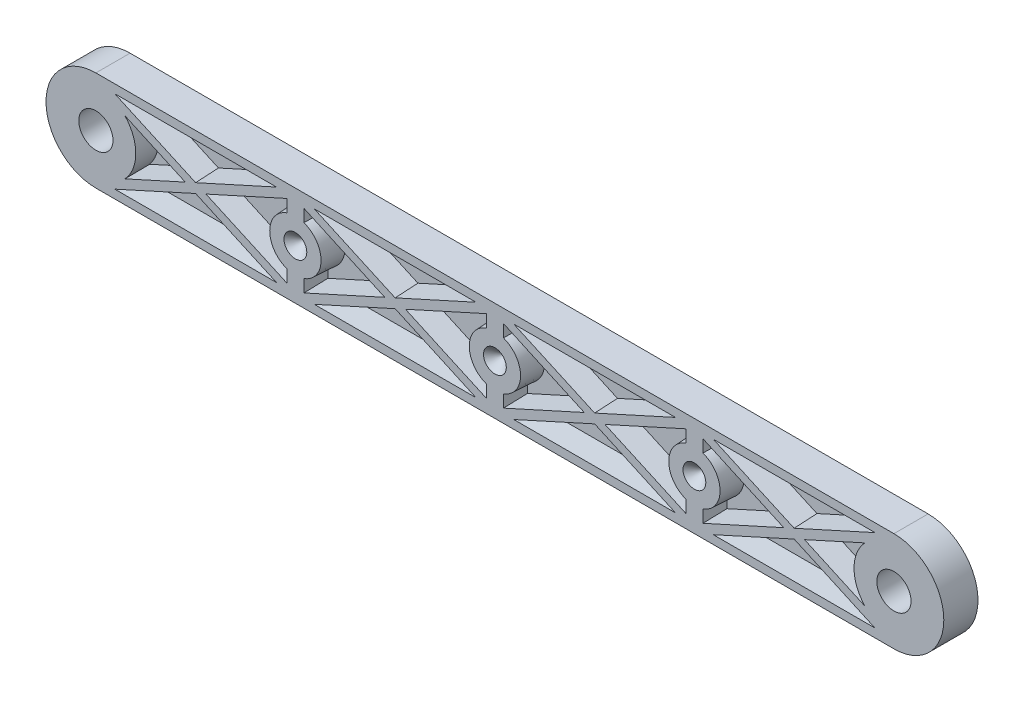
ISO-10303-21;
HEADER;
FILE_DESCRIPTION(('STEP AP214'),'2;1');
FILE_NAME('part.step','',(''),(''),'','','');
FILE_SCHEMA(('AUTOMOTIVE_DESIGN { 1 0 10303 214 1 1 1 1 }'));
ENDSEC;
DATA;
#1=APPLICATION_CONTEXT('core data for automotive mechanical design processes');
#2=APPLICATION_PROTOCOL_DEFINITION('international standard','automotive_design',2000,#1);
#3=PRODUCT_CONTEXT('',#1,'mechanical');
#4=PRODUCT('Part','Part','',(#3));
#5=PRODUCT_RELATED_PRODUCT_CATEGORY('part','',(#4));
#6=PRODUCT_DEFINITION_FORMATION('','',#4);
#7=PRODUCT_DEFINITION_CONTEXT('part definition',#1,'design');
#8=PRODUCT_DEFINITION('design','',#6,#7);
#9=PRODUCT_DEFINITION_SHAPE('','',#8);
#10=(LENGTH_UNIT() NAMED_UNIT(*) SI_UNIT(.MILLI.,.METRE.));
#11=(NAMED_UNIT(*) PLANE_ANGLE_UNIT() SI_UNIT($,.RADIAN.));
#12=(NAMED_UNIT(*) SI_UNIT($,.STERADIAN.) SOLID_ANGLE_UNIT());
#13=UNCERTAINTY_MEASURE_WITH_UNIT(LENGTH_MEASURE(1.E-05),#10,'distance_accuracy_value','');
#14=(GEOMETRIC_REPRESENTATION_CONTEXT(3) GLOBAL_UNCERTAINTY_ASSIGNED_CONTEXT((#13)) GLOBAL_UNIT_ASSIGNED_CONTEXT((#10,
#11,#12)) REPRESENTATION_CONTEXT('',''));
#15=CARTESIAN_POINT('',(0.,0.,0.));
#16=DIRECTION('',(0.,0.,1.));
#17=DIRECTION('',(1.,0.,0.));
#18=AXIS2_PLACEMENT_3D('',#15,#16,#17);
#19=CARTESIAN_POINT('',(235.318623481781,10.3358974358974,0.));
#20=DIRECTION('',(0.,0.,1.));
#21=DIRECTION('',(1.,0.,0.));
#22=AXIS2_PLACEMENT_3D('',#19,#20,#21);
#23=CYLINDRICAL_SURFACE('',#22,6.00000000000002);
#24=CARTESIAN_POINT('',(235.318623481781,10.3358974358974,12.));
#25=DIRECTION('',(0.,0.,1.));
#26=DIRECTION('',(1.,0.,0.));
#27=AXIS2_PLACEMENT_3D('',#24,#25,#26);
#28=CIRCLE('',#27,6.00000000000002);
#29=CARTESIAN_POINT('',(241.318623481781,10.3358974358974,12.));
#30=VERTEX_POINT('',#29);
#31=EDGE_CURVE('E1798',#30,#30,#28,.T.);
#32=ORIENTED_EDGE('',*,*,#31,.T.);
#33=EDGE_LOOP('',(#32));
#34=FACE_BOUND('',#33,.T.);
#35=CARTESIAN_POINT('',(235.318623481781,10.3358974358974,2.));
#36=DIRECTION('',(0.,0.,-1.));
#37=DIRECTION('',(-1.,0.,0.));
#38=AXIS2_PLACEMENT_3D('',#35,#36,#37);
#39=CIRCLE('',#38,6.00000000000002);
#40=CARTESIAN_POINT('',(229.318623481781,10.3358974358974,2.));
#41=VERTEX_POINT('',#40);
#42=EDGE_CURVE('E40',#41,#41,#39,.F.);
#43=ORIENTED_EDGE('',*,*,#42,.F.);
#44=EDGE_LOOP('',(#43));
#45=FACE_BOUND('',#44,.T.);
#46=ADVANCED_FACE('F36',(#34,#45),#23,.F.);
#47=CARTESIAN_POINT('',(-44.6813765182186,10.3358974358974,12.));
#48=DIRECTION('',(0.,0.,-1.));
#49=DIRECTION('',(-1.,0.,0.));
#50=AXIS2_PLACEMENT_3D('',#47,#48,#49);
#51=CYLINDRICAL_SURFACE('',#50,17.5);
#52=CARTESIAN_POINT('',(-44.6813765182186,10.3358974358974,0.));
#53=DIRECTION('',(0.,0.,1.));
#54=DIRECTION('',(1.,0.,0.));
#55=AXIS2_PLACEMENT_3D('',#52,#53,#54);
#56=CIRCLE('',#55,17.5);
#57=CARTESIAN_POINT('',(-44.6813765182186,27.8358974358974,0.));
#58=VERTEX_POINT('',#57);
#59=CARTESIAN_POINT('',(-44.6813765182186,-7.16410256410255,0.));
#60=VERTEX_POINT('',#59);
#61=EDGE_CURVE('E929',#58,#60,#56,.T.);
#62=ORIENTED_EDGE('',*,*,#61,.T.);
#63=DIRECTION('',(0.,0.,-1.));
#64=VECTOR('',#63,1.);
#65=CARTESIAN_POINT('',(-44.6813765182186,-7.16410256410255,12.));
#66=LINE('',#65,#64);
#67=CARTESIAN_POINT('',(-44.6813765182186,-7.16410256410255,12.));
#68=VERTEX_POINT('',#67);
#69=EDGE_CURVE('E1890',#68,#60,#66,.T.);
#70=ORIENTED_EDGE('',*,*,#69,.F.);
#71=CARTESIAN_POINT('',(-44.6813765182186,10.3358974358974,12.));
#72=DIRECTION('',(0.,0.,1.));
#73=DIRECTION('',(1.,0.,0.));
#74=AXIS2_PLACEMENT_3D('',#71,#72,#73);
#75=CIRCLE('',#74,17.5);
#76=CARTESIAN_POINT('',(-44.6813765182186,27.8358974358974,12.));
#77=VERTEX_POINT('',#76);
#78=EDGE_CURVE('E1910',#77,#68,#75,.T.);
#79=ORIENTED_EDGE('',*,*,#78,.F.);
#80=DIRECTION('',(0.,0.,-1.));
#81=VECTOR('',#80,1.);
#82=CARTESIAN_POINT('',(-44.6813765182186,27.8358974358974,12.));
#83=LINE('',#82,#81);
#84=EDGE_CURVE('E1901',#77,#58,#83,.T.);
#85=ORIENTED_EDGE('',*,*,#84,.T.);
#86=EDGE_LOOP('',(#62,#70,#79,#85));
#87=FACE_BOUND('',#86,.T.);
#88=ADVANCED_FACE('F38',(#87),#51,.T.);
#89=CARTESIAN_POINT('',(-44.6813765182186,-7.16410256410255,12.));
#90=DIRECTION('',(0.,1.,0.));
#91=DIRECTION('',(0.,0.,1.));
#92=AXIS2_PLACEMENT_3D('',#89,#90,#91);
#93=PLANE('',#92);
#94=DIRECTION('',(1.,0.,0.));
#95=VECTOR('',#94,1.);
#96=CARTESIAN_POINT('',(-44.6813765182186,-7.16410256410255,0.));
#97=LINE('',#96,#95);
#98=CARTESIAN_POINT('',(235.318623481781,-7.16410256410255,0.));
#99=VERTEX_POINT('',#98);
#100=EDGE_CURVE('E1917',#60,#99,#97,.T.);
#101=ORIENTED_EDGE('',*,*,#100,.T.);
#102=DIRECTION('',(0.,0.,-1.));
#103=VECTOR('',#102,1.);
#104=CARTESIAN_POINT('',(235.318623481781,-7.16410256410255,12.));
#105=LINE('',#104,#103);
#106=CARTESIAN_POINT('',(235.318623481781,-7.16410256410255,12.));
#107=VERTEX_POINT('',#106);
#108=EDGE_CURVE('E1893',#107,#99,#105,.T.);
#109=ORIENTED_EDGE('',*,*,#108,.F.);
#110=DIRECTION('',(1.,0.,0.));
#111=VECTOR('',#110,1.);
#112=CARTESIAN_POINT('',(-44.6813765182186,-7.16410256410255,12.));
#113=LINE('',#112,#111);
#114=EDGE_CURVE('E1908',#68,#107,#113,.T.);
#115=ORIENTED_EDGE('',*,*,#114,.F.);
#116=ORIENTED_EDGE('',*,*,#69,.T.);
#117=EDGE_LOOP('',(#101,#109,#115,#116));
#118=FACE_BOUND('',#117,.T.);
#119=ADVANCED_FACE('F968',(#118),#93,.F.);
#120=CARTESIAN_POINT('',(235.318623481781,10.3358974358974,12.));
#121=DIRECTION('',(0.,0.,-1.));
#122=DIRECTION('',(-1.,0.,0.));
#123=AXIS2_PLACEMENT_3D('',#120,#121,#122);
#124=CYLINDRICAL_SURFACE('',#123,17.5);
#125=CARTESIAN_POINT('',(235.318623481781,10.3358974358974,0.));
#126=DIRECTION('',(0.,0.,1.));
#127=DIRECTION('',(1.,0.,0.));
#128=AXIS2_PLACEMENT_3D('',#125,#126,#127);
#129=CIRCLE('',#128,17.5);
#130=CARTESIAN_POINT('',(235.318623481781,27.8358974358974,0.));
#131=VERTEX_POINT('',#130);
#132=EDGE_CURVE('E1915',#99,#131,#129,.T.);
#133=ORIENTED_EDGE('',*,*,#132,.T.);
#134=DIRECTION('',(0.,0.,-1.));
#135=VECTOR('',#134,1.);
#136=CARTESIAN_POINT('',(235.318623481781,27.8358974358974,12.));
#137=LINE('',#136,#135);
#138=CARTESIAN_POINT('',(235.318623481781,27.8358974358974,12.));
#139=VERTEX_POINT('',#138);
#140=EDGE_CURVE('E1898',#139,#131,#137,.T.);
#141=ORIENTED_EDGE('',*,*,#140,.F.);
#142=CARTESIAN_POINT('',(235.318623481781,10.3358974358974,12.));
#143=DIRECTION('',(0.,0.,1.));
#144=DIRECTION('',(1.,0.,0.));
#145=AXIS2_PLACEMENT_3D('',#142,#143,#144);
#146=CIRCLE('',#145,17.5);
#147=EDGE_CURVE('E1906',#107,#139,#146,.T.);
#148=ORIENTED_EDGE('',*,*,#147,.F.);
#149=ORIENTED_EDGE('',*,*,#108,.T.);
#150=EDGE_LOOP('',(#133,#141,#148,#149));
#151=FACE_BOUND('',#150,.T.);
#152=ADVANCED_FACE('F965',(#151),#124,.T.);
#153=CARTESIAN_POINT('',(-44.6813765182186,27.8358974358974,12.));
#154=DIRECTION('',(0.,-1.,0.));
#155=DIRECTION('',(0.,0.,-1.));
#156=AXIS2_PLACEMENT_3D('',#153,#154,#155);
#157=PLANE('',#156);
#158=DIRECTION('',(-1.,0.,0.));
#159=VECTOR('',#158,1.);
#160=CARTESIAN_POINT('',(-44.6813765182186,27.8358974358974,0.));
#161=LINE('',#160,#159);
#162=EDGE_CURVE('E1913',#131,#58,#161,.T.);
#163=ORIENTED_EDGE('',*,*,#162,.T.);
#164=ORIENTED_EDGE('',*,*,#84,.F.);
#165=DIRECTION('',(-1.,0.,0.));
#166=VECTOR('',#165,1.);
#167=CARTESIAN_POINT('',(-44.6813765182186,27.8358974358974,12.));
#168=LINE('',#167,#166);
#169=EDGE_CURVE('E1904',#139,#77,#168,.T.);
#170=ORIENTED_EDGE('',*,*,#169,.F.);
#171=ORIENTED_EDGE('',*,*,#140,.T.);
#172=EDGE_LOOP('',(#163,#164,#170,#171));
#173=FACE_BOUND('',#172,.T.);
#174=ADVANCED_FACE('F961',(#173),#157,.F.);
#175=CARTESIAN_POINT('',(-44.6813765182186,10.3358974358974,12.));
#176=DIRECTION('',(0.,0.,1.));
#177=DIRECTION('',(1.,0.,0.));
#178=AXIS2_PLACEMENT_3D('',#175,#176,#177);
#179=PLANE('',#178);
#180=ORIENTED_EDGE('',*,*,#31,.F.);
#181=EDGE_LOOP('',(#180));
#182=FACE_BOUND('',#181,.T.);
#183=CARTESIAN_POINT('',(-44.6813765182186,10.3358974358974,12.));
#184=DIRECTION('',(0.,0.,1.));
#185=DIRECTION('',(1.,0.,0.));
#186=AXIS2_PLACEMENT_3D('',#183,#184,#185);
#187=CIRCLE('',#186,6.);
#188=CARTESIAN_POINT('',(-38.6813765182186,10.3358974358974,12.));
#189=VERTEX_POINT('',#188);
#190=EDGE_CURVE('E1800',#189,#189,#187,.T.);
#191=ORIENTED_EDGE('',*,*,#190,.F.);
#192=EDGE_LOOP('',(#191));
#193=FACE_BOUND('',#192,.T.);
#194=DIRECTION('',(-0.9108532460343,-0.412730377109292,0.));
#195=VECTOR('',#194,1.);
#196=CARTESIAN_POINT('',(203.952957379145,10.3358974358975,12.));
#197=LINE('',#196,#195);
#198=CARTESIAN_POINT('',(225.120450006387,19.9274175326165,12.));
#199=VERTEX_POINT('',#198);
#200=CARTESIAN_POINT('',(203.952957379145,10.3358974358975,12.));
#201=VERTEX_POINT('',#200);
#202=EDGE_CURVE('E453',#199,#201,#197,.T.);
#203=ORIENTED_EDGE('',*,*,#202,.F.);
#204=CARTESIAN_POINT('',(235.318623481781,10.3358974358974,12.));
#205=DIRECTION('',(0.,0.,1.));
#206=DIRECTION('',(1.,0.,0.));
#207=AXIS2_PLACEMENT_3D('',#204,#205,#206);
#208=CIRCLE('',#207,14.);
#209=CARTESIAN_POINT('',(225.120450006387,0.744377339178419,12.));
#210=VERTEX_POINT('',#209);
#211=EDGE_CURVE('E463',#199,#210,#208,.T.);
#212=ORIENTED_EDGE('',*,*,#211,.T.);
#213=DIRECTION('',(0.9108532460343,-0.412730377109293,0.));
#214=VECTOR('',#213,1.);
#215=CARTESIAN_POINT('',(203.952957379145,10.3358974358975,12.));
#216=LINE('',#215,#214);
#217=EDGE_CURVE('E52',#201,#210,#216,.T.);
#218=ORIENTED_EDGE('',*,*,#217,.F.);
#219=EDGE_LOOP('',(#203,#212,#218));
#220=FACE_BOUND('',#219,.T.);
#221=DIRECTION('',(0.9108532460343,0.412730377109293,0.));
#222=VECTOR('',#221,1.);
#223=CARTESIAN_POINT('',(-13.3157104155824,10.3358974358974,12.));
#224=LINE('',#223,#222);
#225=CARTESIAN_POINT('',(-34.4832030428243,0.744377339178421,12.));
#226=VERTEX_POINT('',#225);
#227=CARTESIAN_POINT('',(-13.3157104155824,10.3358974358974,12.));
#228=VERTEX_POINT('',#227);
#229=EDGE_CURVE('E1051',#226,#228,#224,.T.);
#230=ORIENTED_EDGE('',*,*,#229,.F.);
#231=CARTESIAN_POINT('',(-44.6813765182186,10.3358974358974,12.));
#232=DIRECTION('',(0.,0.,1.));
#233=DIRECTION('',(1.,0.,0.));
#234=AXIS2_PLACEMENT_3D('',#231,#232,#233);
#235=CIRCLE('',#234,14.);
#236=CARTESIAN_POINT('',(-34.4832030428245,19.9274175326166,12.));
#237=VERTEX_POINT('',#236);
#238=EDGE_CURVE('E460',#226,#237,#235,.T.);
#239=ORIENTED_EDGE('',*,*,#238,.T.);
#240=DIRECTION('',(-0.910853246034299,0.412730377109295,0.));
#241=VECTOR('',#240,1.);
#242=CARTESIAN_POINT('',(-13.3157104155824,10.3358974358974,12.));
#243=LINE('',#242,#241);
#244=EDGE_CURVE('E1066',#228,#237,#243,.T.);
#245=ORIENTED_EDGE('',*,*,#244,.F.);
#246=EDGE_LOOP('',(#230,#239,#245));
#247=FACE_BOUND('',#246,.T.);
#248=CARTESIAN_POINT('',(25.3186234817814,10.3358974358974,12.));
#249=DIRECTION('',(0.,0.,1.));
#250=DIRECTION('',(1.,0.,0.));
#251=AXIS2_PLACEMENT_3D('',#248,#249,#250);
#252=CIRCLE('',#251,4.00000000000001);
#253=CARTESIAN_POINT('',(29.3186234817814,10.3358974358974,12.));
#254=VERTEX_POINT('',#253);
#255=EDGE_CURVE('E476',#254,#254,#252,.T.);
#256=ORIENTED_EDGE('',*,*,#255,.F.);
#257=EDGE_LOOP('',(#256));
#258=FACE_BOUND('',#257,.T.);
#259=DIRECTION('',(0.9108532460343,0.412730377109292,0.));
#260=VECTOR('',#259,1.);
#261=CARTESIAN_POINT('',(18.6842895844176,24.8358974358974,12.));
#262=LINE('',#261,#260);
#263=CARTESIAN_POINT('',(-9.6813765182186,11.9827049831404,12.));
#264=VERTEX_POINT('',#263);
#265=CARTESIAN_POINT('',(18.6842895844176,24.8358974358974,12.));
#266=VERTEX_POINT('',#265);
#267=EDGE_CURVE('E479',#264,#266,#262,.T.);
#268=ORIENTED_EDGE('',*,*,#267,.F.);
#269=DIRECTION('',(0.9108532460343,-0.412730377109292,0.));
#270=VECTOR('',#269,1.);
#271=CARTESIAN_POINT('',(-38.0470426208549,24.8358974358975,12.));
#272=LINE('',#271,#270);
#273=CARTESIAN_POINT('',(-38.0470426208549,24.8358974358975,12.));
#274=VERTEX_POINT('',#273);
#275=EDGE_CURVE('E484',#274,#264,#272,.T.);
#276=ORIENTED_EDGE('',*,*,#275,.F.);
#277=DIRECTION('',(-1.,0.,0.));
#278=VECTOR('',#277,1.);
#279=CARTESIAN_POINT('',(18.6842895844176,24.8358974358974,12.));
#280=LINE('',#279,#278);
#281=EDGE_CURVE('E481',#266,#274,#280,.T.);
#282=ORIENTED_EDGE('',*,*,#281,.F.);
#283=EDGE_LOOP('',(#268,#276,#282));
#284=FACE_BOUND('',#283,.T.);
#285=CARTESIAN_POINT('',(25.3186234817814,10.3358974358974,12.));
#286=DIRECTION('',(0.,0.,-1.));
#287=DIRECTION('',(1.,0.,0.));
#288=AXIS2_PLACEMENT_3D('',#285,#286,#287);
#289=CIRCLE('',#288,9.00000000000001);
#290=CARTESIAN_POINT('',(22.3186234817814,1.85061606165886,12.));
#291=VERTEX_POINT('',#290);
#292=CARTESIAN_POINT('',(22.3186234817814,18.821178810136,12.));
#293=VERTEX_POINT('',#292);
#294=EDGE_CURVE('E490',#291,#293,#289,.T.);
#295=ORIENTED_EDGE('',*,*,#294,.F.);
#296=DIRECTION('',(0.,1.,0.));
#297=VECTOR('',#296,1.);
#298=CARTESIAN_POINT('',(22.3186234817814,1.85061606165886,12.));
#299=LINE('',#298,#297);
#300=CARTESIAN_POINT('',(22.3186234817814,-2.51729501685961,12.));
#301=VERTEX_POINT('',#300);
#302=EDGE_CURVE('E514',#301,#291,#299,.T.);
#303=ORIENTED_EDGE('',*,*,#302,.F.);
#304=DIRECTION('',(0.9108532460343,-0.412730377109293,0.));
#305=VECTOR('',#304,1.);
#306=CARTESIAN_POINT('',(-6.0470426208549,10.3358974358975,12.));
#307=LINE('',#306,#305);
#308=CARTESIAN_POINT('',(-6.0470426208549,10.3358974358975,12.));
#309=VERTEX_POINT('',#308);
#310=EDGE_CURVE('E511',#309,#301,#307,.T.);
#311=ORIENTED_EDGE('',*,*,#310,.F.);
#312=DIRECTION('',(-0.9108532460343,-0.412730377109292,0.));
#313=VECTOR('',#312,1.);
#314=CARTESIAN_POINT('',(-6.0470426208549,10.3358974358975,12.));
#315=LINE('',#314,#313);
#316=CARTESIAN_POINT('',(22.3186234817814,23.1890898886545,12.));
#317=VERTEX_POINT('',#316);
#318=EDGE_CURVE('E508',#317,#309,#315,.T.);
#319=ORIENTED_EDGE('',*,*,#318,.F.);
#320=DIRECTION('',(0.,1.,0.));
#321=VECTOR('',#320,1.);
#322=CARTESIAN_POINT('',(22.3186234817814,23.1890898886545,12.));
#323=LINE('',#322,#321);
#324=EDGE_CURVE('E505',#293,#317,#323,.T.);
#325=ORIENTED_EDGE('',*,*,#324,.F.);
#326=EDGE_LOOP('',(#295,#303,#311,#319,#325));
#327=FACE_BOUND('',#326,.T.);
#328=DIRECTION('',(-0.9108532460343,0.412730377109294,0.));
#329=VECTOR('',#328,1.);
#330=CARTESIAN_POINT('',(18.6842895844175,-4.16410256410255,12.));
#331=LINE('',#330,#329);
#332=CARTESIAN_POINT('',(18.6842895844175,-4.16410256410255,12.));
#333=VERTEX_POINT('',#332);
#334=CARTESIAN_POINT('',(-9.68137651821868,8.68908988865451,12.));
#335=VERTEX_POINT('',#334);
#336=EDGE_CURVE('E526',#333,#335,#331,.T.);
#337=ORIENTED_EDGE('',*,*,#336,.F.);
#338=DIRECTION('',(1.,0.,0.));
#339=VECTOR('',#338,1.);
#340=CARTESIAN_POINT('',(-38.0470426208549,-4.16410256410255,12.));
#341=LINE('',#340,#339);
#342=CARTESIAN_POINT('',(-38.0470426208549,-4.16410256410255,12.));
#343=VERTEX_POINT('',#342);
#344=EDGE_CURVE('E1045',#343,#333,#341,.T.);
#345=ORIENTED_EDGE('',*,*,#344,.F.);
#346=DIRECTION('',(-0.9108532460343,-0.412730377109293,0.));
#347=VECTOR('',#346,1.);
#348=CARTESIAN_POINT('',(-38.0470426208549,-4.16410256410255,12.));
#349=LINE('',#348,#347);
#350=EDGE_CURVE('E1042',#335,#343,#349,.T.);
#351=ORIENTED_EDGE('',*,*,#350,.F.);
#352=EDGE_LOOP('',(#337,#345,#351));
#353=FACE_BOUND('',#352,.T.);
#354=DIRECTION('',(0.9108532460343,0.412730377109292,0.));
#355=VECTOR('',#354,1.);
#356=CARTESIAN_POINT('',(88.6842895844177,24.8358974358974,12.));
#357=LINE('',#356,#355);
#358=CARTESIAN_POINT('',(60.3186234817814,11.9827049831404,12.));
#359=VERTEX_POINT('',#358);
#360=CARTESIAN_POINT('',(88.6842895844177,24.8358974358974,12.));
#361=VERTEX_POINT('',#360);
#362=EDGE_CURVE('E1072',#359,#361,#357,.T.);
#363=ORIENTED_EDGE('',*,*,#362,.F.);
#364=DIRECTION('',(0.9108532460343,-0.412730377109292,0.));
#365=VECTOR('',#364,1.);
#366=CARTESIAN_POINT('',(31.9529573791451,24.8358974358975,12.));
#367=LINE('',#366,#365);
#368=CARTESIAN_POINT('',(31.9529573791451,24.8358974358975,12.));
#369=VERTEX_POINT('',#368);
#370=EDGE_CURVE('E1080',#369,#359,#367,.T.);
#371=ORIENTED_EDGE('',*,*,#370,.F.);
#372=DIRECTION('',(-1.,0.,0.));
#373=VECTOR('',#372,1.);
#374=CARTESIAN_POINT('',(88.6842895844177,24.8358974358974,12.));
#375=LINE('',#374,#373);
#376=EDGE_CURVE('E1077',#361,#369,#375,.T.);
#377=ORIENTED_EDGE('',*,*,#376,.F.);
#378=EDGE_LOOP('',(#363,#371,#377));
#379=FACE_BOUND('',#378,.T.);
#380=CARTESIAN_POINT('',(95.3186234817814,10.3358974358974,12.));
#381=DIRECTION('',(0.,0.,-1.));
#382=DIRECTION('',(1.,0.,0.));
#383=AXIS2_PLACEMENT_3D('',#380,#381,#382);
#384=CIRCLE('',#383,9.00000000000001);
#385=CARTESIAN_POINT('',(92.3186234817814,1.85061606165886,12.));
#386=VERTEX_POINT('',#385);
#387=CARTESIAN_POINT('',(92.3186234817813,18.821178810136,12.));
#388=VERTEX_POINT('',#387);
#389=EDGE_CURVE('E1086',#386,#388,#384,.T.);
#390=ORIENTED_EDGE('',*,*,#389,.F.);
#391=DIRECTION('',(0.,1.,0.));
#392=VECTOR('',#391,1.);
#393=CARTESIAN_POINT('',(92.3186234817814,1.85061606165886,12.));
#394=LINE('',#393,#392);
#395=CARTESIAN_POINT('',(92.3186234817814,-2.51729501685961,12.));
#396=VERTEX_POINT('',#395);
#397=EDGE_CURVE('E625',#396,#386,#394,.T.);
#398=ORIENTED_EDGE('',*,*,#397,.F.);
#399=DIRECTION('',(0.9108532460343,-0.412730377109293,0.));
#400=VECTOR('',#399,1.);
#401=CARTESIAN_POINT('',(63.9529573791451,10.3358974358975,12.));
#402=LINE('',#401,#400);
#403=CARTESIAN_POINT('',(63.9529573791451,10.3358974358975,12.));
#404=VERTEX_POINT('',#403);
#405=EDGE_CURVE('E1106',#404,#396,#402,.T.);
#406=ORIENTED_EDGE('',*,*,#405,.F.);
#407=DIRECTION('',(-0.9108532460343,-0.412730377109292,0.));
#408=VECTOR('',#407,1.);
#409=CARTESIAN_POINT('',(63.9529573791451,10.3358974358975,12.));
#410=LINE('',#409,#408);
#411=CARTESIAN_POINT('',(92.3186234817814,23.1890898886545,12.));
#412=VERTEX_POINT('',#411);
#413=EDGE_CURVE('E1104',#412,#404,#410,.T.);
#414=ORIENTED_EDGE('',*,*,#413,.F.);
#415=DIRECTION('',(0.,1.,0.));
#416=VECTOR('',#415,1.);
#417=CARTESIAN_POINT('',(92.3186234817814,23.1890898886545,12.));
#418=LINE('',#417,#416);
#419=EDGE_CURVE('E1101',#388,#412,#418,.T.);
#420=ORIENTED_EDGE('',*,*,#419,.F.);
#421=EDGE_LOOP('',(#390,#398,#406,#414,#420));
#422=FACE_BOUND('',#421,.T.);
#423=DIRECTION('',(-0.9108532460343,0.412730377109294,0.));
#424=VECTOR('',#423,1.);
#425=CARTESIAN_POINT('',(88.6842895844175,-4.16410256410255,12.));
#426=LINE('',#425,#424);
#427=CARTESIAN_POINT('',(88.6842895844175,-4.16410256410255,12.));
#428=VERTEX_POINT('',#427);
#429=CARTESIAN_POINT('',(60.3186234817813,8.68908988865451,12.));
#430=VERTEX_POINT('',#429);
#431=EDGE_CURVE('E623',#428,#430,#426,.T.);
#432=ORIENTED_EDGE('',*,*,#431,.F.);
#433=DIRECTION('',(1.,0.,0.));
#434=VECTOR('',#433,1.);
#435=CARTESIAN_POINT('',(31.9529573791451,-4.16410256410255,12.));
#436=LINE('',#435,#434);
#437=CARTESIAN_POINT('',(31.9529573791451,-4.16410256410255,12.));
#438=VERTEX_POINT('',#437);
#439=EDGE_CURVE('E1133',#438,#428,#436,.T.);
#440=ORIENTED_EDGE('',*,*,#439,.F.);
#441=DIRECTION('',(-0.9108532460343,-0.412730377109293,0.));
#442=VECTOR('',#441,1.);
#443=CARTESIAN_POINT('',(31.9529573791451,-4.16410256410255,12.));
#444=LINE('',#443,#442);
#445=EDGE_CURVE('E1130',#430,#438,#444,.T.);
#446=ORIENTED_EDGE('',*,*,#445,.F.);
#447=EDGE_LOOP('',(#432,#440,#446));
#448=FACE_BOUND('',#447,.T.);
#449=CARTESIAN_POINT('',(25.3186234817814,10.3358974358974,12.));
#450=DIRECTION('',(0.,0.,-1.));
#451=DIRECTION('',(1.,0.,0.));
#452=AXIS2_PLACEMENT_3D('',#449,#450,#451);
#453=CIRCLE('',#452,8.99999999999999);
#454=CARTESIAN_POINT('',(28.3186234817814,18.821178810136,12.));
#455=VERTEX_POINT('',#454);
#456=CARTESIAN_POINT('',(28.3186234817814,1.85061606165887,12.));
#457=VERTEX_POINT('',#456);
#458=EDGE_CURVE('E1139',#455,#457,#453,.T.);
#459=ORIENTED_EDGE('',*,*,#458,.F.);
#460=DIRECTION('',(0.,-1.,0.));
#461=VECTOR('',#460,1.);
#462=CARTESIAN_POINT('',(28.3186234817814,23.1890898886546,12.));
#463=LINE('',#462,#461);
#464=CARTESIAN_POINT('',(28.3186234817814,23.1890898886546,12.));
#465=VERTEX_POINT('',#464);
#466=EDGE_CURVE('E688',#465,#455,#463,.T.);
#467=ORIENTED_EDGE('',*,*,#466,.F.);
#468=DIRECTION('',(-0.910853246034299,0.412730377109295,0.));
#469=VECTOR('',#468,1.);
#470=CARTESIAN_POINT('',(56.6842895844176,10.3358974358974,12.));
#471=LINE('',#470,#469);
#472=CARTESIAN_POINT('',(56.6842895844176,10.3358974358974,12.));
#473=VERTEX_POINT('',#472);
#474=EDGE_CURVE('E1159',#473,#465,#471,.T.);
#475=ORIENTED_EDGE('',*,*,#474,.F.);
#476=DIRECTION('',(0.9108532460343,0.412730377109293,0.));
#477=VECTOR('',#476,1.);
#478=CARTESIAN_POINT('',(56.6842895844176,10.3358974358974,12.));
#479=LINE('',#478,#477);
#480=CARTESIAN_POINT('',(28.3186234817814,-2.51729501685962,12.));
#481=VERTEX_POINT('',#480);
#482=EDGE_CURVE('E1157',#481,#473,#479,.T.);
#483=ORIENTED_EDGE('',*,*,#482,.F.);
#484=DIRECTION('',(0.,-1.,0.));
#485=VECTOR('',#484,1.);
#486=CARTESIAN_POINT('',(28.3186234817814,1.85061606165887,12.));
#487=LINE('',#486,#485);
#488=EDGE_CURVE('E1154',#457,#481,#487,.T.);
#489=ORIENTED_EDGE('',*,*,#488,.F.);
#490=EDGE_LOOP('',(#459,#467,#475,#483,#489));
#491=FACE_BOUND('',#490,.T.);
#492=CARTESIAN_POINT('',(165.318623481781,10.3358974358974,12.));
#493=DIRECTION('',(0.,0.,1.));
#494=DIRECTION('',(1.,0.,0.));
#495=AXIS2_PLACEMENT_3D('',#492,#493,#494);
#496=CIRCLE('',#495,4.00000000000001);
#497=CARTESIAN_POINT('',(169.318623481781,10.3358974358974,12.));
#498=VERTEX_POINT('',#497);
#499=EDGE_CURVE('E686',#498,#498,#496,.T.);
#500=ORIENTED_EDGE('',*,*,#499,.F.);
#501=EDGE_LOOP('',(#500));
#502=FACE_BOUND('',#501,.T.);
#503=DIRECTION('',(-0.9108532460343,0.412730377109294,0.));
#504=VECTOR('',#503,1.);
#505=CARTESIAN_POINT('',(228.684289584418,-4.16410256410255,12.));
#506=LINE('',#505,#504);
#507=CARTESIAN_POINT('',(228.684289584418,-4.16410256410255,12.));
#508=VERTEX_POINT('',#507);
#509=CARTESIAN_POINT('',(200.318623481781,8.68908988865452,12.));
#510=VERTEX_POINT('',#509);
#511=EDGE_CURVE('E1209',#508,#510,#506,.T.);
#512=ORIENTED_EDGE('',*,*,#511,.F.);
#513=DIRECTION('',(1.,0.,0.));
#514=VECTOR('',#513,1.);
#515=CARTESIAN_POINT('',(171.952957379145,-4.16410256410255,12.));
#516=LINE('',#515,#514);
#517=CARTESIAN_POINT('',(171.952957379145,-4.16410256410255,12.));
#518=VERTEX_POINT('',#517);
#519=EDGE_CURVE('E1204',#518,#508,#516,.T.);
#520=ORIENTED_EDGE('',*,*,#519,.F.);
#521=DIRECTION('',(-0.9108532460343,-0.412730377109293,0.));
#522=VECTOR('',#521,1.);
#523=CARTESIAN_POINT('',(171.952957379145,-4.16410256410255,12.));
#524=LINE('',#523,#522);
#525=EDGE_CURVE('E1189',#510,#518,#524,.T.);
#526=ORIENTED_EDGE('',*,*,#525,.F.);
#527=EDGE_LOOP('',(#512,#520,#526));
#528=FACE_BOUND('',#527,.T.);
#529=CARTESIAN_POINT('',(165.318623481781,10.3358974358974,12.));
#530=DIRECTION('',(0.,0.,-1.));
#531=DIRECTION('',(1.,0.,0.));
#532=AXIS2_PLACEMENT_3D('',#529,#530,#531);
#533=CIRCLE('',#532,8.99999999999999);
#534=CARTESIAN_POINT('',(168.318623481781,18.821178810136,12.));
#535=VERTEX_POINT('',#534);
#536=CARTESIAN_POINT('',(168.318623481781,1.85061606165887,12.));
#537=VERTEX_POINT('',#536);
#538=EDGE_CURVE('E784',#535,#537,#533,.T.);
#539=ORIENTED_EDGE('',*,*,#538,.F.);
#540=DIRECTION('',(0.,-1.,0.));
#541=VECTOR('',#540,1.);
#542=CARTESIAN_POINT('',(168.318623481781,23.1890898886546,12.));
#543=LINE('',#542,#541);
#544=CARTESIAN_POINT('',(168.318623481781,23.1890898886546,12.));
#545=VERTEX_POINT('',#544);
#546=EDGE_CURVE('E785',#545,#535,#543,.T.);
#547=ORIENTED_EDGE('',*,*,#546,.F.);
#548=DIRECTION('',(-0.910853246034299,0.412730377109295,0.));
#549=VECTOR('',#548,1.);
#550=CARTESIAN_POINT('',(196.684289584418,10.3358974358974,12.));
#551=LINE('',#550,#549);
#552=CARTESIAN_POINT('',(196.684289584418,10.3358974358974,12.));
#553=VERTEX_POINT('',#552);
#554=EDGE_CURVE('E1238',#553,#545,#551,.T.);
#555=ORIENTED_EDGE('',*,*,#554,.F.);
#556=DIRECTION('',(0.9108532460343,0.412730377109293,0.));
#557=VECTOR('',#556,1.);
#558=CARTESIAN_POINT('',(196.684289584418,10.3358974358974,12.));
#559=LINE('',#558,#557);
#560=CARTESIAN_POINT('',(168.318623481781,-2.51729501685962,12.));
#561=VERTEX_POINT('',#560);
#562=EDGE_CURVE('E761',#561,#553,#559,.T.);
#563=ORIENTED_EDGE('',*,*,#562,.F.);
#564=DIRECTION('',(0.,-1.,0.));
#565=VECTOR('',#564,1.);
#566=CARTESIAN_POINT('',(168.318623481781,1.85061606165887,12.));
#567=LINE('',#566,#565);
#568=EDGE_CURVE('E1211',#537,#561,#567,.T.);
#569=ORIENTED_EDGE('',*,*,#568,.F.);
#570=EDGE_LOOP('',(#539,#547,#555,#563,#569));
#571=FACE_BOUND('',#570,.T.);
#572=DIRECTION('',(0.9108532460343,0.412730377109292,0.));
#573=VECTOR('',#572,1.);
#574=CARTESIAN_POINT('',(228.684289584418,24.8358974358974,12.));
#575=LINE('',#574,#573);
#576=CARTESIAN_POINT('',(200.318623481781,11.9827049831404,12.));
#577=VERTEX_POINT('',#576);
#578=CARTESIAN_POINT('',(228.684289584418,24.8358974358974,12.));
#579=VERTEX_POINT('',#578);
#580=EDGE_CURVE('E808',#577,#579,#575,.T.);
#581=ORIENTED_EDGE('',*,*,#580,.F.);
#582=DIRECTION('',(0.9108532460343,-0.412730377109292,0.));
#583=VECTOR('',#582,1.);
#584=CARTESIAN_POINT('',(171.952957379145,24.8358974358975,12.));
#585=LINE('',#584,#583);
#586=CARTESIAN_POINT('',(171.952957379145,24.8358974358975,12.));
#587=VERTEX_POINT('',#586);
#588=EDGE_CURVE('E803',#587,#577,#585,.T.);
#589=ORIENTED_EDGE('',*,*,#588,.F.);
#590=DIRECTION('',(-1.,0.,0.));
#591=VECTOR('',#590,1.);
#592=CARTESIAN_POINT('',(228.684289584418,24.8358974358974,12.));
#593=LINE('',#592,#591);
#594=EDGE_CURVE('E788',#579,#587,#593,.T.);
#595=ORIENTED_EDGE('',*,*,#594,.F.);
#596=EDGE_LOOP('',(#581,#589,#595));
#597=FACE_BOUND('',#596,.T.);
#598=CARTESIAN_POINT('',(95.3186234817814,10.3358974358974,12.));
#599=DIRECTION('',(0.,0.,1.));
#600=DIRECTION('',(1.,0.,0.));
#601=AXIS2_PLACEMENT_3D('',#598,#599,#600);
#602=CIRCLE('',#601,4.00000000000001);
#603=CARTESIAN_POINT('',(99.3186234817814,10.3358974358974,12.));
#604=VERTEX_POINT('',#603);
#605=EDGE_CURVE('E810',#604,#604,#602,.T.);
#606=ORIENTED_EDGE('',*,*,#605,.F.);
#607=EDGE_LOOP('',(#606));
#608=FACE_BOUND('',#607,.T.);
#609=DIRECTION('',(0.9108532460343,0.412730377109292,0.));
#610=VECTOR('',#609,1.);
#611=CARTESIAN_POINT('',(158.684289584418,24.8358974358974,12.));
#612=LINE('',#611,#610);
#613=CARTESIAN_POINT('',(130.318623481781,11.9827049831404,12.));
#614=VERTEX_POINT('',#613);
#615=CARTESIAN_POINT('',(158.684289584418,24.8358974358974,12.));
#616=VERTEX_POINT('',#615);
#617=EDGE_CURVE('E813',#614,#616,#612,.T.);
#618=ORIENTED_EDGE('',*,*,#617,.F.);
#619=DIRECTION('',(0.9108532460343,-0.412730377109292,0.));
#620=VECTOR('',#619,1.);
#621=CARTESIAN_POINT('',(101.952957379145,24.8358974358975,12.));
#622=LINE('',#621,#620);
#623=CARTESIAN_POINT('',(101.952957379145,24.8358974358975,12.));
#624=VERTEX_POINT('',#623);
#625=EDGE_CURVE('E818',#624,#614,#622,.T.);
#626=ORIENTED_EDGE('',*,*,#625,.F.);
#627=DIRECTION('',(-1.,0.,0.));
#628=VECTOR('',#627,1.);
#629=CARTESIAN_POINT('',(158.684289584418,24.8358974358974,12.));
#630=LINE('',#629,#628);
#631=EDGE_CURVE('E815',#616,#624,#630,.T.);
#632=ORIENTED_EDGE('',*,*,#631,.F.);
#633=EDGE_LOOP('',(#618,#626,#632));
#634=FACE_BOUND('',#633,.T.);
#635=CARTESIAN_POINT('',(165.318623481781,10.3358974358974,12.));
#636=DIRECTION('',(0.,0.,-1.));
#637=DIRECTION('',(1.,0.,0.));
#638=AXIS2_PLACEMENT_3D('',#635,#636,#637);
#639=CIRCLE('',#638,9.00000000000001);
#640=CARTESIAN_POINT('',(162.318623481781,1.85061606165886,12.));
#641=VERTEX_POINT('',#640);
#642=CARTESIAN_POINT('',(162.318623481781,18.821178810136,12.));
#643=VERTEX_POINT('',#642);
#644=EDGE_CURVE('E824',#641,#643,#639,.T.);
#645=ORIENTED_EDGE('',*,*,#644,.F.);
#646=DIRECTION('',(0.,1.,0.));
#647=VECTOR('',#646,1.);
#648=CARTESIAN_POINT('',(162.318623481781,1.85061606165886,12.));
#649=LINE('',#648,#647);
#650=CARTESIAN_POINT('',(162.318623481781,-2.51729501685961,12.));
#651=VERTEX_POINT('',#650);
#652=EDGE_CURVE('E848',#651,#641,#649,.T.);
#653=ORIENTED_EDGE('',*,*,#652,.F.);
#654=DIRECTION('',(0.9108532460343,-0.412730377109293,0.));
#655=VECTOR('',#654,1.);
#656=CARTESIAN_POINT('',(133.952957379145,10.3358974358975,12.));
#657=LINE('',#656,#655);
#658=CARTESIAN_POINT('',(133.952957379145,10.3358974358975,12.));
#659=VERTEX_POINT('',#658);
#660=EDGE_CURVE('E845',#659,#651,#657,.T.);
#661=ORIENTED_EDGE('',*,*,#660,.F.);
#662=DIRECTION('',(-0.9108532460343,-0.412730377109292,0.));
#663=VECTOR('',#662,1.);
#664=CARTESIAN_POINT('',(133.952957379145,10.3358974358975,12.));
#665=LINE('',#664,#663);
#666=CARTESIAN_POINT('',(162.318623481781,23.1890898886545,12.));
#667=VERTEX_POINT('',#666);
#668=EDGE_CURVE('E842',#667,#659,#665,.T.);
#669=ORIENTED_EDGE('',*,*,#668,.F.);
#670=DIRECTION('',(0.,1.,0.));
#671=VECTOR('',#670,1.);
#672=CARTESIAN_POINT('',(162.318623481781,23.1890898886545,12.));
#673=LINE('',#672,#671);
#674=EDGE_CURVE('E839',#643,#667,#673,.T.);
#675=ORIENTED_EDGE('',*,*,#674,.F.);
#676=EDGE_LOOP('',(#645,#653,#661,#669,#675));
#677=FACE_BOUND('',#676,.T.);
#678=DIRECTION('',(-0.9108532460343,0.412730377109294,0.));
#679=VECTOR('',#678,1.);
#680=CARTESIAN_POINT('',(158.684289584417,-4.16410256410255,12.));
#681=LINE('',#680,#679);
#682=CARTESIAN_POINT('',(158.684289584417,-4.16410256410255,12.));
#683=VERTEX_POINT('',#682);
#684=CARTESIAN_POINT('',(130.318623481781,8.68908988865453,12.));
#685=VERTEX_POINT('',#684);
#686=EDGE_CURVE('E860',#683,#685,#681,.T.);
#687=ORIENTED_EDGE('',*,*,#686,.F.);
#688=DIRECTION('',(1.,0.,0.));
#689=VECTOR('',#688,1.);
#690=CARTESIAN_POINT('',(101.952957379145,-4.16410256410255,12.));
#691=LINE('',#690,#689);
#692=CARTESIAN_POINT('',(101.952957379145,-4.16410256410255,12.));
#693=VERTEX_POINT('',#692);
#694=EDGE_CURVE('E1968',#693,#683,#691,.T.);
#695=ORIENTED_EDGE('',*,*,#694,.F.);
#696=DIRECTION('',(-0.9108532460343,-0.412730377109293,0.));
#697=VECTOR('',#696,1.);
#698=CARTESIAN_POINT('',(101.952957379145,-4.16410256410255,12.));
#699=LINE('',#698,#697);
#700=EDGE_CURVE('E1976',#685,#693,#699,.T.);
#701=ORIENTED_EDGE('',*,*,#700,.F.);
#702=EDGE_LOOP('',(#687,#695,#701));
#703=FACE_BOUND('',#702,.T.);
#704=CARTESIAN_POINT('',(95.3186234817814,10.3358974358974,12.));
#705=DIRECTION('',(0.,0.,-1.));
#706=DIRECTION('',(1.,0.,0.));
#707=AXIS2_PLACEMENT_3D('',#704,#705,#706);
#708=CIRCLE('',#707,8.99999999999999);
#709=CARTESIAN_POINT('',(98.3186234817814,18.821178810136,12.));
#710=VERTEX_POINT('',#709);
#711=CARTESIAN_POINT('',(98.3186234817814,1.85061606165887,12.));
#712=VERTEX_POINT('',#711);
#713=EDGE_CURVE('E1949',#710,#712,#708,.T.);
#714=ORIENTED_EDGE('',*,*,#713,.F.);
#715=DIRECTION('',(0.,-1.,0.));
#716=VECTOR('',#715,1.);
#717=CARTESIAN_POINT('',(98.3186234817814,23.1890898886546,12.));
#718=LINE('',#717,#716);
#719=CARTESIAN_POINT('',(98.3186234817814,23.1890898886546,12.));
#720=VERTEX_POINT('',#719);
#721=EDGE_CURVE('E931',#720,#710,#718,.T.);
#722=ORIENTED_EDGE('',*,*,#721,.F.);
#723=DIRECTION('',(-0.910853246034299,0.412730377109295,0.));
#724=VECTOR('',#723,1.);
#725=CARTESIAN_POINT('',(126.684289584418,10.3358974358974,12.));
#726=LINE('',#725,#724);
#727=CARTESIAN_POINT('',(126.684289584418,10.3358974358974,12.));
#728=VERTEX_POINT('',#727);
#729=EDGE_CURVE('E1953',#728,#720,#726,.T.);
#730=ORIENTED_EDGE('',*,*,#729,.F.);
#731=DIRECTION('',(0.9108532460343,0.412730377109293,0.));
#732=VECTOR('',#731,1.);
#733=CARTESIAN_POINT('',(126.684289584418,10.3358974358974,12.));
#734=LINE('',#733,#732);
#735=CARTESIAN_POINT('',(98.3186234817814,-2.51729501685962,12.));
#736=VERTEX_POINT('',#735);
#737=EDGE_CURVE('E1942',#736,#728,#734,.T.);
#738=ORIENTED_EDGE('',*,*,#737,.F.);
#739=DIRECTION('',(0.,-1.,0.));
#740=VECTOR('',#739,1.);
#741=CARTESIAN_POINT('',(98.3186234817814,1.85061606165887,12.));
#742=LINE('',#741,#740);
#743=EDGE_CURVE('E1946',#712,#736,#742,.T.);
#744=ORIENTED_EDGE('',*,*,#743,.F.);
#745=EDGE_LOOP('',(#714,#722,#730,#738,#744));
#746=FACE_BOUND('',#745,.T.);
#747=ORIENTED_EDGE('',*,*,#78,.T.);
#748=ORIENTED_EDGE('',*,*,#114,.T.);
#749=ORIENTED_EDGE('',*,*,#147,.T.);
#750=ORIENTED_EDGE('',*,*,#169,.T.);
#751=EDGE_LOOP('',(#747,#748,#749,#750));
#752=FACE_BOUND('',#751,.T.);
#753=ADVANCED_FACE('F957',(#182,#193,#220,#247,#258,#284,#327,#353,#379,#422,#448,#491,#502,
#528,#571,#597,#608,#634,#677,#703,#746,#752),#179,.T.);
#754=CARTESIAN_POINT('',(-44.6813765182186,10.3358974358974,0.));
#755=DIRECTION('',(0.,0.,1.));
#756=DIRECTION('',(1.,0.,0.));
#757=AXIS2_PLACEMENT_3D('',#754,#755,#756);
#758=PLANE('',#757);
#759=CARTESIAN_POINT('',(235.318623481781,10.3358974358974,0.));
#760=DIRECTION('',(0.,0.,-1.));
#761=DIRECTION('',(-1.,0.,0.));
#762=AXIS2_PLACEMENT_3D('',#759,#760,#761);
#763=CIRCLE('',#762,12.5);
#764=CARTESIAN_POINT('',(222.818623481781,10.3358974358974,0.));
#765=VERTEX_POINT('',#764);
#766=EDGE_CURVE('E1794',#765,#765,#763,.T.);
#767=ORIENTED_EDGE('',*,*,#766,.F.);
#768=EDGE_LOOP('',(#767));
#769=FACE_BOUND('',#768,.T.);
#770=CARTESIAN_POINT('',(-44.6813765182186,10.3358974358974,0.));
#771=DIRECTION('',(0.,0.,1.));
#772=DIRECTION('',(1.,0.,0.));
#773=AXIS2_PLACEMENT_3D('',#770,#771,#772);
#774=CIRCLE('',#773,6.);
#775=CARTESIAN_POINT('',(-38.6813765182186,10.3358974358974,0.));
#776=VERTEX_POINT('',#775);
#777=EDGE_CURVE('E465',#776,#776,#774,.T.);
#778=ORIENTED_EDGE('',*,*,#777,.T.);
#779=EDGE_LOOP('',(#778));
#780=FACE_BOUND('',#779,.T.);
#781=ORIENTED_EDGE('',*,*,#61,.F.);
#782=ORIENTED_EDGE('',*,*,#162,.F.);
#783=ORIENTED_EDGE('',*,*,#132,.F.);
#784=ORIENTED_EDGE('',*,*,#100,.F.);
#785=EDGE_LOOP('',(#781,#782,#783,#784));
#786=FACE_BOUND('',#785,.T.);
#787=ADVANCED_FACE('F954',(#769,#780,#786),#758,.F.);
#788=CARTESIAN_POINT('',(95.3186234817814,10.3358974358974,12.));
#789=DIRECTION('',(0.,0.,-1.));
#790=DIRECTION('',(1.,0.,0.));
#791=AXIS2_PLACEMENT_3D('',#788,#789,#790);
#792=CONICAL_SURFACE('',#791,8.99999999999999,0.05235987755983);
#793=ORIENTED_EDGE('',*,*,#713,.T.);
#794=CARTESIAN_POINT('',(98.7378857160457,1.55915847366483,4.));
#795=CARTESIAN_POINT('',(98.6680071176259,1.60691570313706,5.33336308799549));
#796=CARTESIAN_POINT('',(98.5981292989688,1.65508245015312,6.66671129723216));
#797=CARTESIAN_POINT('',(98.4583752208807,1.75223497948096,9.33337796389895));
#798=CARTESIAN_POINT('',(98.3884989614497,1.80122076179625,10.6666964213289));
#799=CARTESIAN_POINT('',(98.3186234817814,1.85061606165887,12.));
#800=B_SPLINE_CURVE_WITH_KNOTS('',3,(#794,#795,#796,#797,#798,#799),.UNSPECIFIED.,.F.,.F.,(4,2,
4),(0.,4.00813965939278,8.01627933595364),.UNSPECIFIED.);
#801=CARTESIAN_POINT('',(98.7378857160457,1.55915847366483,4.));
#802=VERTEX_POINT('',#801);
#803=EDGE_CURVE('E933',#802,#712,#800,.T.);
#804=ORIENTED_EDGE('',*,*,#803,.F.);
#805=CARTESIAN_POINT('',(95.3186234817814,10.3358974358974,4.));
#806=DIRECTION('',(0.,0.,1.));
#807=DIRECTION('',(1.,0.,0.));
#808=AXIS2_PLACEMENT_3D('',#805,#806,#807);
#809=CIRCLE('',#808,9.41926223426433);
#810=CARTESIAN_POINT('',(98.7378857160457,19.11263639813,4.));
#811=VERTEX_POINT('',#810);
#812=EDGE_CURVE('E1925',#811,#802,#809,.F.);
#813=ORIENTED_EDGE('',*,*,#812,.F.);
#814=CARTESIAN_POINT('',(98.7378857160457,19.11263639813,4.));
#815=CARTESIAN_POINT('',(98.6680071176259,19.0648791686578,5.33336308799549));
#816=CARTESIAN_POINT('',(98.5981292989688,19.0167124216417,6.66671129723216));
#817=CARTESIAN_POINT('',(98.4583752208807,18.9195598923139,9.33337796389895));
#818=CARTESIAN_POINT('',(98.3884989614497,18.8705741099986,10.6666964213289));
#819=CARTESIAN_POINT('',(98.3186234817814,18.821178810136,12.));
#820=B_SPLINE_CURVE_WITH_KNOTS('',3,(#814,#815,#816,#817,#818,#819),.UNSPECIFIED.,.F.,.F.,(4,2,
4),(0.,4.00813965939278,8.01627933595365),.UNSPECIFIED.);
#821=EDGE_CURVE('E922',#811,#710,#820,.T.);
#822=ORIENTED_EDGE('',*,*,#821,.T.);
#823=EDGE_LOOP('',(#793,#804,#813,#822));
#824=FACE_BOUND('',#823,.T.);
#825=ADVANCED_FACE('F917',(#824),#792,.T.);
#826=CARTESIAN_POINT('',(98.3186234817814,23.1890898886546,12.));
#827=DIRECTION('',(-0.998629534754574,0.,-0.0523359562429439));
#828=DIRECTION('',(-0.052335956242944,0.,0.998629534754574));
#829=AXIS2_PLACEMENT_3D('',#826,#827,#828);
#830=PLANE('',#829);
#831=ORIENTED_EDGE('',*,*,#721,.T.);
#832=ORIENTED_EDGE('',*,*,#821,.F.);
#833=DIRECTION('',(0.,-1.,0.));
#834=VECTOR('',#833,1.);
#835=CARTESIAN_POINT('',(98.7378857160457,10.3358974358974,4.));
#836=LINE('',#835,#834);
#837=CARTESIAN_POINT('',(98.7378857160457,22.5388155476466,4.));
#838=VERTEX_POINT('',#837);
#839=EDGE_CURVE('E941',#838,#811,#836,.T.);
#840=ORIENTED_EDGE('',*,*,#839,.F.);
#841=DIRECTION('',(-0.0521643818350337,0.0809067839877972,0.995355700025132));
#842=VECTOR('',#841,1.);
#843=CARTESIAN_POINT('',(98.4500562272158,22.9852381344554,9.49211381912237));
#844=LINE('',#843,#842);
#845=EDGE_CURVE('E930',#838,#720,#844,.T.);
#846=ORIENTED_EDGE('',*,*,#845,.T.);
#847=EDGE_LOOP('',(#831,#832,#840,#846));
#848=FACE_BOUND('',#847,.T.);
#849=ADVANCED_FACE('F912',(#848),#830,.F.);
#850=CARTESIAN_POINT('',(126.684289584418,10.3358974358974,12.));
#851=DIRECTION('',(0.412164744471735,0.909604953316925,-0.0523359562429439));
#852=DIRECTION('',(-0.910853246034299,0.412730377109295,0.));
#853=AXIS2_PLACEMENT_3D('',#850,#851,#852);
#854=PLANE('',#853);
#855=ORIENTED_EDGE('',*,*,#729,.T.);
#856=ORIENTED_EDGE('',*,*,#845,.F.);
#857=DIRECTION('',(-0.910853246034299,0.412730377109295,0.));
#858=VECTOR('',#857,1.);
#859=CARTESIAN_POINT('',(100.488608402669,21.7455193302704,4.));
#860=LINE('',#859,#858);
#861=CARTESIAN_POINT('',(125.668463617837,10.3358974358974,4.));
#862=VERTEX_POINT('',#861);
#863=EDGE_CURVE('E1928',#862,#838,#860,.T.);
#864=ORIENTED_EDGE('',*,*,#863,.F.);
#865=DIRECTION('',(0.125966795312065,0.,0.992034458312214));
#866=VECTOR('',#865,1.);
#867=CARTESIAN_POINT('',(126.684289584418,10.3358974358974,12.));
#868=LINE('',#867,#866);
#869=EDGE_CURVE('E1935',#862,#728,#868,.T.);
#870=ORIENTED_EDGE('',*,*,#869,.T.);
#871=EDGE_LOOP('',(#855,#856,#864,#870));
#872=FACE_BOUND('',#871,.T.);
#873=ADVANCED_FACE('F916',(#872),#854,.F.);
#874=CARTESIAN_POINT('',(126.684289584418,10.3358974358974,12.));
#875=DIRECTION('',(0.412164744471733,-0.909604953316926,-0.0523359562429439));
#876=DIRECTION('',(0.9108532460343,0.412730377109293,0.));
#877=AXIS2_PLACEMENT_3D('',#874,#875,#876);
#878=PLANE('',#877);
#879=ORIENTED_EDGE('',*,*,#737,.T.);
#880=ORIENTED_EDGE('',*,*,#869,.F.);
#881=DIRECTION('',(0.9108532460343,0.412730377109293,0.));
#882=VECTOR('',#881,1.);
#883=CARTESIAN_POINT('',(100.488608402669,-1.07372445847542,4.));
#884=LINE('',#883,#882);
#885=CARTESIAN_POINT('',(98.7378857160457,-1.86702067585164,4.));
#886=VERTEX_POINT('',#885);
#887=EDGE_CURVE('E1924',#886,#862,#884,.T.);
#888=ORIENTED_EDGE('',*,*,#887,.F.);
#889=DIRECTION('',(-0.0521643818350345,-0.0809067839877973,0.995355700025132));
#890=VECTOR('',#889,1.);
#891=CARTESIAN_POINT('',(98.3370580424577,-2.48870307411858,11.648247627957));
#892=LINE('',#891,#890);
#893=EDGE_CURVE('E940',#886,#736,#892,.T.);
#894=ORIENTED_EDGE('',*,*,#893,.T.);
#895=EDGE_LOOP('',(#879,#880,#888,#894));
#896=FACE_BOUND('',#895,.T.);
#897=ADVANCED_FACE('F946',(#896),#878,.F.);
#898=CARTESIAN_POINT('',(98.3186234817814,1.85061606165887,12.));
#899=DIRECTION('',(-0.998629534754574,0.,-0.0523359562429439));
#900=DIRECTION('',(-0.052335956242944,0.,0.998629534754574));
#901=AXIS2_PLACEMENT_3D('',#898,#899,#900);
#902=PLANE('',#901);
#903=ORIENTED_EDGE('',*,*,#743,.T.);
#904=ORIENTED_EDGE('',*,*,#893,.F.);
#905=DIRECTION('',(0.,-1.,0.));
#906=VECTOR('',#905,1.);
#907=CARTESIAN_POINT('',(98.7378857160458,10.3358974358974,4.));
#908=LINE('',#907,#906);
#909=EDGE_CURVE('E1921',#802,#886,#908,.T.);
#910=ORIENTED_EDGE('',*,*,#909,.F.);
#911=ORIENTED_EDGE('',*,*,#803,.T.);
#912=EDGE_LOOP('',(#903,#904,#910,#911));
#913=FACE_BOUND('',#912,.T.);
#914=ADVANCED_FACE('F910',(#913),#902,.F.);
#915=CARTESIAN_POINT('',(95.3186234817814,10.3358974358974,4.));
#916=DIRECTION('',(0.,0.,1.));
#917=DIRECTION('',(1.,0.,0.));
#918=AXIS2_PLACEMENT_3D('',#915,#916,#917);
#919=PLANE('',#918);
#920=ORIENTED_EDGE('',*,*,#812,.T.);
#921=ORIENTED_EDGE('',*,*,#909,.T.);
#922=ORIENTED_EDGE('',*,*,#887,.T.);
#923=ORIENTED_EDGE('',*,*,#863,.T.);
#924=ORIENTED_EDGE('',*,*,#839,.T.);
#925=EDGE_LOOP('',(#920,#921,#922,#923,#924));
#926=FACE_BOUND('',#925,.T.);
#927=ADVANCED_FACE('F900',(#926),#919,.T.);
#928=CARTESIAN_POINT('',(158.684289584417,-4.16410256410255,12.));
#929=DIRECTION('',(0.412164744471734,0.909604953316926,-0.0523359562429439));
#930=DIRECTION('',(-0.910853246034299,0.412730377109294,0.));
#931=AXIS2_PLACEMENT_3D('',#928,#929,#930);
#932=PLANE('',#931);
#933=ORIENTED_EDGE('',*,*,#686,.T.);
#934=DIRECTION('',(0.,0.0574420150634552,0.998348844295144));
#935=VECTOR('',#934,1.);
#936=CARTESIAN_POINT('',(130.318623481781,8.64667968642,11.2629057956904));
#937=LINE('',#936,#935);
#938=CARTESIAN_POINT('',(130.318623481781,8.22879374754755,4.));
#939=VERTEX_POINT('',#938);
#940=EDGE_CURVE('E1965',#939,#685,#937,.T.);
#941=ORIENTED_EDGE('',*,*,#940,.F.);
#942=DIRECTION('',(-0.910853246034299,0.412730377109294,0.));
#943=VECTOR('',#942,1.);
#944=CARTESIAN_POINT('',(158.511247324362,-4.54598893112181,4.));
#945=LINE('',#944,#943);
#946=CARTESIAN_POINT('',(156.743195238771,-3.74484032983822,4.));
#947=VERTEX_POINT('',#946);
#948=EDGE_CURVE('E1962',#947,#939,#945,.T.);
#949=ORIENTED_EDGE('',*,*,#948,.F.);
#950=DIRECTION('',(0.235489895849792,-0.0508641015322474,0.970544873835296));
#951=VECTOR('',#950,1.);
#952=CARTESIAN_POINT('',(155.538225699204,-3.48457568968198,-0.966145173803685));
#953=LINE('',#952,#951);
#954=EDGE_CURVE('E1957',#947,#683,#953,.T.);
#955=ORIENTED_EDGE('',*,*,#954,.T.);
#956=EDGE_LOOP('',(#933,#941,#949,#955));
#957=FACE_BOUND('',#956,.T.);
#958=ADVANCED_FACE('F896',(#957),#932,.F.);
#959=CARTESIAN_POINT('',(101.952957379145,-4.16410256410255,12.));
#960=DIRECTION('',(0.,-0.998629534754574,-0.0523359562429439));
#961=DIRECTION('',(0.,0.052335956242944,-0.998629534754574));
#962=AXIS2_PLACEMENT_3D('',#959,#960,#961);
#963=PLANE('',#962);
#964=ORIENTED_EDGE('',*,*,#694,.T.);
#965=ORIENTED_EDGE('',*,*,#954,.F.);
#966=DIRECTION('',(1.,0.,0.));
#967=VECTOR('',#966,1.);
#968=CARTESIAN_POINT('',(101.952957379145,-3.74484032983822,4.));
#969=LINE('',#968,#967);
#970=CARTESIAN_POINT('',(103.894051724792,-3.74484032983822,4.));
#971=VERTEX_POINT('',#970);
#972=EDGE_CURVE('E1961',#971,#947,#969,.T.);
#973=ORIENTED_EDGE('',*,*,#972,.F.);
#974=DIRECTION('',(-0.235489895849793,-0.0508641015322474,0.970544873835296));
#975=VECTOR('',#974,1.);
#976=CARTESIAN_POINT('',(101.952957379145,-4.16410256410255,12.));
#977=LINE('',#976,#975);
#978=EDGE_CURVE('E1969',#971,#693,#977,.T.);
#979=ORIENTED_EDGE('',*,*,#978,.T.);
#980=EDGE_LOOP('',(#964,#965,#973,#979));
#981=FACE_BOUND('',#980,.T.);
#982=ADVANCED_FACE('F899',(#981),#963,.F.);
#983=CARTESIAN_POINT('',(101.952957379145,-4.16410256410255,12.));
#984=DIRECTION('',(-0.412164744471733,0.909604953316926,-0.0523359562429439));
#985=DIRECTION('',(-0.9108532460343,-0.412730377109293,0.));
#986=AXIS2_PLACEMENT_3D('',#983,#984,#985);
#987=PLANE('',#986);
#988=ORIENTED_EDGE('',*,*,#700,.T.);
#989=ORIENTED_EDGE('',*,*,#978,.F.);
#990=DIRECTION('',(-0.9108532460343,-0.412730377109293,0.));
#991=VECTOR('',#990,1.);
#992=CARTESIAN_POINT('',(102.125999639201,-4.54598893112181,4.));
#993=LINE('',#992,#991);
#994=EDGE_CURVE('E1958',#939,#971,#993,.T.);
#995=ORIENTED_EDGE('',*,*,#994,.F.);
#996=ORIENTED_EDGE('',*,*,#940,.T.);
#997=EDGE_LOOP('',(#988,#989,#995,#996));
#998=FACE_BOUND('',#997,.T.);
#999=ADVANCED_FACE('F894',(#998),#987,.F.);
#1000=CARTESIAN_POINT('',(130.318623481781,8.68908988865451,4.));
#1001=DIRECTION('',(0.,0.,-1.));
#1002=DIRECTION('',(-1.,0.,0.));
#1003=AXIS2_PLACEMENT_3D('',#1000,#1001,#1002);
#1004=PLANE('',#1003);
#1005=ORIENTED_EDGE('',*,*,#948,.T.);
#1006=ORIENTED_EDGE('',*,*,#994,.T.);
#1007=ORIENTED_EDGE('',*,*,#972,.T.);
#1008=EDGE_LOOP('',(#1005,#1006,#1007));
#1009=FACE_BOUND('',#1008,.T.);
#1010=ADVANCED_FACE('F875',(#1009),#1004,.F.);
#1011=CARTESIAN_POINT('',(165.318623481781,10.3358974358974,12.));
#1012=DIRECTION('',(0.,0.,-1.));
#1013=DIRECTION('',(1.,0.,0.));
#1014=AXIS2_PLACEMENT_3D('',#1011,#1012,#1013);
#1015=CONICAL_SURFACE('',#1014,9.00000000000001,0.05235987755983);
#1016=ORIENTED_EDGE('',*,*,#644,.T.);
#1017=CARTESIAN_POINT('',(161.899361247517,19.1126363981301,4.));
#1018=CARTESIAN_POINT('',(161.969239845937,19.0648791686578,5.33336308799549));
#1019=CARTESIAN_POINT('',(162.039117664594,19.0167124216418,6.66671129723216));
#1020=CARTESIAN_POINT('',(162.178871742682,18.9195598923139,9.33337796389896));
#1021=CARTESIAN_POINT('',(162.248748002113,18.8705741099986,10.6666964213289));
#1022=CARTESIAN_POINT('',(162.318623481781,18.821178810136,12.));
#1023=B_SPLINE_CURVE_WITH_KNOTS('',3,(#1017,#1018,#1019,#1020,#1021,#1022),.UNSPECIFIED.,.F.,
.F.,(4,2,4),(0.,4.00813965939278,8.01627933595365),.UNSPECIFIED.);
#1024=CARTESIAN_POINT('',(161.899361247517,19.1126363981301,4.));
#1025=VERTEX_POINT('',#1024);
#1026=EDGE_CURVE('E862',#1025,#643,#1023,.T.);
#1027=ORIENTED_EDGE('',*,*,#1026,.F.);
#1028=CARTESIAN_POINT('',(165.318623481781,10.3358974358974,4.));
#1029=DIRECTION('',(0.,0.,1.));
#1030=DIRECTION('',(1.,0.,0.));
#1031=AXIS2_PLACEMENT_3D('',#1028,#1029,#1030);
#1032=CIRCLE('',#1031,9.41926223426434);
#1033=CARTESIAN_POINT('',(161.899361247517,1.55915847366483,4.));
#1034=VERTEX_POINT('',#1033);
#1035=EDGE_CURVE('E851',#1034,#1025,#1032,.F.);
#1036=ORIENTED_EDGE('',*,*,#1035,.F.);
#1037=CARTESIAN_POINT('',(161.899361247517,1.55915847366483,4.));
#1038=CARTESIAN_POINT('',(161.969239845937,1.60691570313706,5.33336308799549));
#1039=CARTESIAN_POINT('',(162.039117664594,1.65508245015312,6.66671129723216));
#1040=CARTESIAN_POINT('',(162.178871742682,1.75223497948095,9.33337796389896));
#1041=CARTESIAN_POINT('',(162.248748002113,1.80122076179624,10.6666964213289));
#1042=CARTESIAN_POINT('',(162.318623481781,1.85061606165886,12.));
#1043=B_SPLINE_CURVE_WITH_KNOTS('',3,(#1037,#1038,#1039,#1040,#1041,#1042),.UNSPECIFIED.,.F.,
.F.,(4,2,4),(0.,4.00813965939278,8.01627933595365),.UNSPECIFIED.);
#1044=EDGE_CURVE('E852',#1034,#641,#1043,.T.);
#1045=ORIENTED_EDGE('',*,*,#1044,.T.);
#1046=EDGE_LOOP('',(#1016,#1027,#1036,#1045));
#1047=FACE_BOUND('',#1046,.T.);
#1048=ADVANCED_FACE('F872',(#1047),#1015,.T.);
#1049=CARTESIAN_POINT('',(162.318623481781,1.85061606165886,12.));
#1050=DIRECTION('',(0.998629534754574,0.,-0.0523359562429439));
#1051=DIRECTION('',(-0.052335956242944,0.,-0.998629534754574));
#1052=AXIS2_PLACEMENT_3D('',#1049,#1050,#1051);
#1053=PLANE('',#1052);
#1054=ORIENTED_EDGE('',*,*,#652,.T.);
#1055=ORIENTED_EDGE('',*,*,#1044,.F.);
#1056=DIRECTION('',(0.,1.,0.));
#1057=VECTOR('',#1056,1.);
#1058=CARTESIAN_POINT('',(161.899361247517,10.3358974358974,4.));
#1059=LINE('',#1058,#1057);
#1060=CARTESIAN_POINT('',(161.899361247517,-1.86702067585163,4.));
#1061=VERTEX_POINT('',#1060);
#1062=EDGE_CURVE('E1989',#1061,#1034,#1059,.T.);
#1063=ORIENTED_EDGE('',*,*,#1062,.F.);
#1064=DIRECTION('',(0.0521643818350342,-0.0809067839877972,0.995355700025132));
#1065=VECTOR('',#1064,1.);
#1066=CARTESIAN_POINT('',(162.187190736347,-2.31344326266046,9.49211381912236));
#1067=LINE('',#1066,#1065);
#1068=EDGE_CURVE('E861',#1061,#651,#1067,.T.);
#1069=ORIENTED_EDGE('',*,*,#1068,.T.);
#1070=EDGE_LOOP('',(#1054,#1055,#1063,#1069));
#1071=FACE_BOUND('',#1070,.T.);
#1072=ADVANCED_FACE('F869',(#1071),#1053,.F.);
#1073=CARTESIAN_POINT('',(133.952957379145,10.3358974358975,12.));
#1074=DIRECTION('',(-0.412164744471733,-0.909604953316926,-0.0523359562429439));
#1075=DIRECTION('',(0.9108532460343,-0.412730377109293,0.));
#1076=AXIS2_PLACEMENT_3D('',#1073,#1074,#1075);
#1077=PLANE('',#1076);
#1078=ORIENTED_EDGE('',*,*,#660,.T.);
#1079=ORIENTED_EDGE('',*,*,#1068,.F.);
#1080=DIRECTION('',(0.9108532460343,-0.412730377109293,0.));
#1081=VECTOR('',#1080,1.);
#1082=CARTESIAN_POINT('',(160.148638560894,-1.07372445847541,4.));
#1083=LINE('',#1082,#1081);
#1084=CARTESIAN_POINT('',(134.968783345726,10.3358974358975,4.));
#1085=VERTEX_POINT('',#1084);
#1086=EDGE_CURVE('E1986',#1085,#1061,#1083,.T.);
#1087=ORIENTED_EDGE('',*,*,#1086,.F.);
#1088=DIRECTION('',(-0.125966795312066,0.,0.992034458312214));
#1089=VECTOR('',#1088,1.);
#1090=CARTESIAN_POINT('',(133.952957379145,10.3358974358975,12.));
#1091=LINE('',#1090,#1089);
#1092=EDGE_CURVE('E1995',#1085,#659,#1091,.T.);
#1093=ORIENTED_EDGE('',*,*,#1092,.T.);
#1094=EDGE_LOOP('',(#1078,#1079,#1087,#1093));
#1095=FACE_BOUND('',#1094,.T.);
#1096=ADVANCED_FACE('F887',(#1095),#1077,.F.);
#1097=CARTESIAN_POINT('',(133.952957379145,10.3358974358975,12.));
#1098=DIRECTION('',(-0.412164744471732,0.909604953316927,-0.0523359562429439));
#1099=DIRECTION('',(-0.9108532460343,-0.412730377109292,0.));
#1100=AXIS2_PLACEMENT_3D('',#1097,#1098,#1099);
#1101=PLANE('',#1100);
#1102=ORIENTED_EDGE('',*,*,#668,.T.);
#1103=ORIENTED_EDGE('',*,*,#1092,.F.);
#1104=DIRECTION('',(-0.9108532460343,-0.412730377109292,0.));
#1105=VECTOR('',#1104,1.);
#1106=CARTESIAN_POINT('',(160.148638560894,21.7455193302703,4.));
#1107=LINE('',#1106,#1105);
#1108=CARTESIAN_POINT('',(161.899361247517,22.5388155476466,4.));
#1109=VERTEX_POINT('',#1108);
#1110=EDGE_CURVE('E1983',#1109,#1085,#1107,.T.);
#1111=ORIENTED_EDGE('',*,*,#1110,.F.);
#1112=DIRECTION('',(0.0521643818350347,0.0809067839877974,0.995355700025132));
#1113=VECTOR('',#1112,1.);
#1114=CARTESIAN_POINT('',(162.318623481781,23.1890898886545,12.));
#1115=LINE('',#1114,#1113);
#1116=EDGE_CURVE('E1996',#1109,#667,#1115,.T.);
#1117=ORIENTED_EDGE('',*,*,#1116,.T.);
#1118=EDGE_LOOP('',(#1102,#1103,#1111,#1117));
#1119=FACE_BOUND('',#1118,.T.);
#1120=ADVANCED_FACE('F883',(#1119),#1101,.F.);
#1121=CARTESIAN_POINT('',(162.318623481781,23.1890898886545,12.));
#1122=DIRECTION('',(0.998629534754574,0.,-0.0523359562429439));
#1123=DIRECTION('',(-0.052335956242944,0.,-0.998629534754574));
#1124=AXIS2_PLACEMENT_3D('',#1121,#1122,#1123);
#1125=PLANE('',#1124);
#1126=ORIENTED_EDGE('',*,*,#674,.T.);
#1127=ORIENTED_EDGE('',*,*,#1116,.F.);
#1128=DIRECTION('',(0.,1.,0.));
#1129=VECTOR('',#1128,1.);
#1130=CARTESIAN_POINT('',(161.899361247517,10.3358974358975,4.));
#1131=LINE('',#1130,#1129);
#1132=EDGE_CURVE('E1980',#1025,#1109,#1131,.T.);
#1133=ORIENTED_EDGE('',*,*,#1132,.F.);
#1134=ORIENTED_EDGE('',*,*,#1026,.T.);
#1135=EDGE_LOOP('',(#1126,#1127,#1133,#1134));
#1136=FACE_BOUND('',#1135,.T.);
#1137=ADVANCED_FACE('F877',(#1136),#1125,.F.);
#1138=CARTESIAN_POINT('',(165.318623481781,10.3358974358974,4.));
#1139=DIRECTION('',(0.,0.,1.));
#1140=DIRECTION('',(1.,0.,0.));
#1141=AXIS2_PLACEMENT_3D('',#1138,#1139,#1140);
#1142=PLANE('',#1141);
#1143=ORIENTED_EDGE('',*,*,#1035,.T.);
#1144=ORIENTED_EDGE('',*,*,#1132,.T.);
#1145=ORIENTED_EDGE('',*,*,#1110,.T.);
#1146=ORIENTED_EDGE('',*,*,#1086,.T.);
#1147=ORIENTED_EDGE('',*,*,#1062,.T.);
#1148=EDGE_LOOP('',(#1143,#1144,#1145,#1146,#1147));
#1149=FACE_BOUND('',#1148,.T.);
#1150=ADVANCED_FACE('F882',(#1149),#1142,.T.);
#1151=CARTESIAN_POINT('',(158.684289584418,24.8358974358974,12.));
#1152=DIRECTION('',(0.412164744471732,-0.909604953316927,-0.0523359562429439));
#1153=DIRECTION('',(0.9108532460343,0.412730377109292,0.));
#1154=AXIS2_PLACEMENT_3D('',#1151,#1152,#1153);
#1155=PLANE('',#1154);
#1156=ORIENTED_EDGE('',*,*,#617,.T.);
#1157=DIRECTION('',(0.235489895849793,0.0508641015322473,0.970544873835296));
#1158=VECTOR('',#1157,1.);
#1159=CARTESIAN_POINT('',(158.684289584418,24.8358974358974,12.));
#1160=LINE('',#1159,#1158);
#1161=CARTESIAN_POINT('',(156.743195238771,24.4166352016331,4.));
#1162=VERTEX_POINT('',#1161);
#1163=EDGE_CURVE('E826',#1162,#616,#1160,.T.);
#1164=ORIENTED_EDGE('',*,*,#1163,.F.);
#1165=DIRECTION('',(0.9108532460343,0.412730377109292,0.));
#1166=VECTOR('',#1165,1.);
#1167=CARTESIAN_POINT('',(130.145581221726,12.3645913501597,4.));
#1168=LINE('',#1167,#1166);
#1169=CARTESIAN_POINT('',(130.318623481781,12.4430011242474,4.));
#1170=VERTEX_POINT('',#1169);
#1171=EDGE_CURVE('E821',#1170,#1162,#1168,.T.);
#1172=ORIENTED_EDGE('',*,*,#1171,.F.);
#1173=DIRECTION('',(0.,-0.0574420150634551,0.998348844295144));
#1174=VECTOR('',#1173,1.);
#1175=CARTESIAN_POINT('',(130.318623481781,12.0251151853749,11.2629057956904));
#1176=LINE('',#1175,#1174);
#1177=EDGE_CURVE('E822',#1170,#614,#1176,.T.);
#1178=ORIENTED_EDGE('',*,*,#1177,.T.);
#1179=EDGE_LOOP('',(#1156,#1164,#1172,#1178));
#1180=FACE_BOUND('',#1179,.T.);
#1181=ADVANCED_FACE('F1319',(#1180),#1155,.F.);
#1182=CARTESIAN_POINT('',(101.952957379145,24.8358974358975,12.));
#1183=DIRECTION('',(-0.412164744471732,-0.909604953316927,-0.0523359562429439));
#1184=DIRECTION('',(0.9108532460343,-0.412730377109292,0.));
#1185=AXIS2_PLACEMENT_3D('',#1182,#1183,#1184);
#1186=PLANE('',#1185);
#1187=ORIENTED_EDGE('',*,*,#625,.T.);
#1188=ORIENTED_EDGE('',*,*,#1177,.F.);
#1189=DIRECTION('',(0.9108532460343,-0.412730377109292,0.));
#1190=VECTOR('',#1189,1.);
#1191=CARTESIAN_POINT('',(130.491665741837,12.3645913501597,4.));
#1192=LINE('',#1191,#1190);
#1193=CARTESIAN_POINT('',(103.894051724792,24.4166352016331,4.));
#1194=VERTEX_POINT('',#1193);
#1195=EDGE_CURVE('E829',#1194,#1170,#1192,.T.);
#1196=ORIENTED_EDGE('',*,*,#1195,.F.);
#1197=DIRECTION('',(-0.235489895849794,0.0508641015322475,0.970544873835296));
#1198=VECTOR('',#1197,1.);
#1199=CARTESIAN_POINT('',(105.099021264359,24.1563705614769,-0.966145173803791));
#1200=LINE('',#1199,#1198);
#1201=EDGE_CURVE('E825',#1194,#624,#1200,.T.);
#1202=ORIENTED_EDGE('',*,*,#1201,.T.);
#1203=EDGE_LOOP('',(#1187,#1188,#1196,#1202));
#1204=FACE_BOUND('',#1203,.T.);
#1205=ADVANCED_FACE('F1311',(#1204),#1186,.F.);
#1206=CARTESIAN_POINT('',(158.684289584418,24.8358974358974,12.));
#1207=DIRECTION('',(0.,0.998629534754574,-0.0523359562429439));
#1208=DIRECTION('',(0.,0.052335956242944,0.998629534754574));
#1209=AXIS2_PLACEMENT_3D('',#1206,#1207,#1208);
#1210=PLANE('',#1209);
#1211=ORIENTED_EDGE('',*,*,#631,.T.);
#1212=ORIENTED_EDGE('',*,*,#1201,.F.);
#1213=DIRECTION('',(-1.,0.,0.));
#1214=VECTOR('',#1213,1.);
#1215=CARTESIAN_POINT('',(130.318623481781,24.4166352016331,4.));
#1216=LINE('',#1215,#1214);
#1217=EDGE_CURVE('E833',#1162,#1194,#1216,.T.);
#1218=ORIENTED_EDGE('',*,*,#1217,.F.);
#1219=ORIENTED_EDGE('',*,*,#1163,.T.);
#1220=EDGE_LOOP('',(#1211,#1212,#1218,#1219));
#1221=FACE_BOUND('',#1220,.T.);
#1222=ADVANCED_FACE('F1303',(#1221),#1210,.F.);
#1223=CARTESIAN_POINT('',(130.318623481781,11.9827049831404,4.));
#1224=DIRECTION('',(0.,0.,1.));
#1225=DIRECTION('',(1.,0.,0.));
#1226=AXIS2_PLACEMENT_3D('',#1223,#1224,#1225);
#1227=PLANE('',#1226);
#1228=ORIENTED_EDGE('',*,*,#1171,.T.);
#1229=ORIENTED_EDGE('',*,*,#1217,.T.);
#1230=ORIENTED_EDGE('',*,*,#1195,.T.);
#1231=EDGE_LOOP('',(#1228,#1229,#1230));
#1232=FACE_BOUND('',#1231,.T.);
#1233=ADVANCED_FACE('F1295',(#1232),#1227,.T.);
#1234=CARTESIAN_POINT('',(95.3186234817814,10.3358974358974,12.));
#1235=DIRECTION('',(0.,0.,1.));
#1236=DIRECTION('',(1.,0.,0.));
#1237=AXIS2_PLACEMENT_3D('',#1234,#1235,#1236);
#1238=CONICAL_SURFACE('',#1237,4.00000000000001,0.78539816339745);
#1239=CARTESIAN_POINT('',(95.3186234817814,10.3358974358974,8.00000000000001));
#1240=VERTEX_POINT('',#1239);
#1241=VERTEX_LOOP('',#1240);
#1242=FACE_BOUND('',#1241,.T.);
#1243=ORIENTED_EDGE('',*,*,#605,.T.);
#1244=EDGE_LOOP('',(#1243));
#1245=FACE_BOUND('',#1244,.T.);
#1246=ADVANCED_FACE('F1268',(#1242,#1245),#1238,.F.);
#1247=CARTESIAN_POINT('',(228.684289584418,24.8358974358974,12.));
#1248=DIRECTION('',(0.412164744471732,-0.909604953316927,-0.0523359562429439));
#1249=DIRECTION('',(0.9108532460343,0.412730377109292,0.));
#1250=AXIS2_PLACEMENT_3D('',#1247,#1248,#1249);
#1251=PLANE('',#1250);
#1252=ORIENTED_EDGE('',*,*,#580,.T.);
#1253=DIRECTION('',(0.235489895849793,0.0508641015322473,0.970544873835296));
#1254=VECTOR('',#1253,1.);
#1255=CARTESIAN_POINT('',(228.684289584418,24.8358974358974,12.));
#1256=LINE('',#1255,#1254);
#1257=CARTESIAN_POINT('',(226.743195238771,24.4166352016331,4.));
#1258=VERTEX_POINT('',#1257);
#1259=EDGE_CURVE('E800',#1258,#579,#1256,.T.);
#1260=ORIENTED_EDGE('',*,*,#1259,.F.);
#1261=DIRECTION('',(0.9108532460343,0.412730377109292,0.));
#1262=VECTOR('',#1261,1.);
#1263=CARTESIAN_POINT('',(200.145581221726,12.3645913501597,4.));
#1264=LINE('',#1263,#1262);
#1265=CARTESIAN_POINT('',(200.318623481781,12.4430011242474,4.));
#1266=VERTEX_POINT('',#1265);
#1267=EDGE_CURVE('E790',#1266,#1258,#1264,.T.);
#1268=ORIENTED_EDGE('',*,*,#1267,.F.);
#1269=DIRECTION('',(0.,-0.0574420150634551,0.998348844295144));
#1270=VECTOR('',#1269,1.);
#1271=CARTESIAN_POINT('',(200.318623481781,12.0251151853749,11.2629057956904));
#1272=LINE('',#1271,#1270);
#1273=EDGE_CURVE('E805',#1266,#577,#1272,.T.);
#1274=ORIENTED_EDGE('',*,*,#1273,.T.);
#1275=EDGE_LOOP('',(#1252,#1260,#1268,#1274));
#1276=FACE_BOUND('',#1275,.T.);
#1277=ADVANCED_FACE('F744',(#1276),#1251,.F.);
#1278=CARTESIAN_POINT('',(171.952957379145,24.8358974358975,12.));
#1279=DIRECTION('',(-0.412164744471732,-0.909604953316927,-0.0523359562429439));
#1280=DIRECTION('',(0.9108532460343,-0.412730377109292,0.));
#1281=AXIS2_PLACEMENT_3D('',#1278,#1279,#1280);
#1282=PLANE('',#1281);
#1283=ORIENTED_EDGE('',*,*,#588,.T.);
#1284=ORIENTED_EDGE('',*,*,#1273,.F.);
#1285=DIRECTION('',(0.9108532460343,-0.412730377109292,0.));
#1286=VECTOR('',#1285,1.);
#1287=CARTESIAN_POINT('',(200.491665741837,12.3645913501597,4.));
#1288=LINE('',#1287,#1286);
#1289=CARTESIAN_POINT('',(173.894051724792,24.4166352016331,4.));
#1290=VERTEX_POINT('',#1289);
#1291=EDGE_CURVE('E794',#1290,#1266,#1288,.T.);
#1292=ORIENTED_EDGE('',*,*,#1291,.F.);
#1293=DIRECTION('',(-0.235489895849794,0.0508641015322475,0.970544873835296));
#1294=VECTOR('',#1293,1.);
#1295=CARTESIAN_POINT('',(175.099021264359,24.1563705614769,-0.966145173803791));
#1296=LINE('',#1295,#1294);
#1297=EDGE_CURVE('E797',#1290,#587,#1296,.T.);
#1298=ORIENTED_EDGE('',*,*,#1297,.T.);
#1299=EDGE_LOOP('',(#1283,#1284,#1292,#1298));
#1300=FACE_BOUND('',#1299,.T.);
#1301=ADVANCED_FACE('F1274',(#1300),#1282,.F.);
#1302=CARTESIAN_POINT('',(228.684289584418,24.8358974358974,12.));
#1303=DIRECTION('',(0.,0.998629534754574,-0.0523359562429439));
#1304=DIRECTION('',(0.,0.052335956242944,0.998629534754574));
#1305=AXIS2_PLACEMENT_3D('',#1302,#1303,#1304);
#1306=PLANE('',#1305);
#1307=ORIENTED_EDGE('',*,*,#594,.T.);
#1308=ORIENTED_EDGE('',*,*,#1297,.F.);
#1309=DIRECTION('',(-1.,0.,0.));
#1310=VECTOR('',#1309,1.);
#1311=CARTESIAN_POINT('',(200.318623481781,24.4166352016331,4.));
#1312=LINE('',#1311,#1310);
#1313=EDGE_CURVE('E792',#1258,#1290,#1312,.T.);
#1314=ORIENTED_EDGE('',*,*,#1313,.F.);
#1315=ORIENTED_EDGE('',*,*,#1259,.T.);
#1316=EDGE_LOOP('',(#1307,#1308,#1314,#1315));
#1317=FACE_BOUND('',#1316,.T.);
#1318=ADVANCED_FACE('F1266',(#1317),#1306,.F.);
#1319=CARTESIAN_POINT('',(200.318623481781,11.9827049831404,4.));
#1320=DIRECTION('',(0.,0.,1.));
#1321=DIRECTION('',(1.,0.,0.));
#1322=AXIS2_PLACEMENT_3D('',#1319,#1320,#1321);
#1323=PLANE('',#1322);
#1324=ORIENTED_EDGE('',*,*,#1267,.T.);
#1325=ORIENTED_EDGE('',*,*,#1313,.T.);
#1326=ORIENTED_EDGE('',*,*,#1291,.T.);
#1327=EDGE_LOOP('',(#1324,#1325,#1326));
#1328=FACE_BOUND('',#1327,.T.);
#1329=ADVANCED_FACE('F770',(#1328),#1323,.T.);
#1330=CARTESIAN_POINT('',(165.318623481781,10.3358974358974,12.));
#1331=DIRECTION('',(0.,0.,-1.));
#1332=DIRECTION('',(1.,0.,0.));
#1333=AXIS2_PLACEMENT_3D('',#1330,#1331,#1332);
#1334=CONICAL_SURFACE('',#1333,8.99999999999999,0.05235987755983);
#1335=ORIENTED_EDGE('',*,*,#538,.T.);
#1336=CARTESIAN_POINT('',(168.737885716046,1.55915847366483,4.));
#1337=CARTESIAN_POINT('',(168.668007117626,1.60691570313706,5.33336308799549));
#1338=CARTESIAN_POINT('',(168.598129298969,1.65508245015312,6.66671129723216));
#1339=CARTESIAN_POINT('',(168.458375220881,1.75223497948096,9.33337796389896));
#1340=CARTESIAN_POINT('',(168.38849896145,1.80122076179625,10.6666964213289));
#1341=CARTESIAN_POINT('',(168.318623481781,1.85061606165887,12.));
#1342=B_SPLINE_CURVE_WITH_KNOTS('',3,(#1336,#1337,#1338,#1339,#1340,#1341),.UNSPECIFIED.,.F.,
.F.,(4,2,4),(0.,4.00813965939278,8.01627933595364),.UNSPECIFIED.);
#1343=CARTESIAN_POINT('',(168.737885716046,1.55915847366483,4.));
#1344=VERTEX_POINT('',#1343);
#1345=EDGE_CURVE('E752',#1344,#537,#1342,.T.);
#1346=ORIENTED_EDGE('',*,*,#1345,.F.);
#1347=CARTESIAN_POINT('',(165.318623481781,10.3358974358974,4.));
#1348=DIRECTION('',(0.,0.,1.));
#1349=DIRECTION('',(1.,0.,0.));
#1350=AXIS2_PLACEMENT_3D('',#1347,#1348,#1349);
#1351=CIRCLE('',#1350,9.41926223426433);
#1352=CARTESIAN_POINT('',(168.737885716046,19.11263639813,4.));
#1353=VERTEX_POINT('',#1352);
#1354=EDGE_CURVE('E1213',#1353,#1344,#1351,.F.);
#1355=ORIENTED_EDGE('',*,*,#1354,.F.);
#1356=CARTESIAN_POINT('',(168.737885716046,19.11263639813,4.));
#1357=CARTESIAN_POINT('',(168.668007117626,19.0648791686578,5.33336308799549));
#1358=CARTESIAN_POINT('',(168.598129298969,19.0167124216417,6.66671129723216));
#1359=CARTESIAN_POINT('',(168.458375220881,18.9195598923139,9.33337796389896));
#1360=CARTESIAN_POINT('',(168.38849896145,18.8705741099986,10.6666964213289));
#1361=CARTESIAN_POINT('',(168.318623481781,18.821178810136,12.));
#1362=B_SPLINE_CURVE_WITH_KNOTS('',3,(#1356,#1357,#1358,#1359,#1360,#1361),.UNSPECIFIED.,.F.,
.F.,(4,2,4),(0.,4.00813965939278,8.01627933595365),.UNSPECIFIED.);
#1363=EDGE_CURVE('E776',#1353,#535,#1362,.T.);
#1364=ORIENTED_EDGE('',*,*,#1363,.T.);
#1365=EDGE_LOOP('',(#1335,#1346,#1355,#1364));
#1366=FACE_BOUND('',#1365,.T.);
#1367=ADVANCED_FACE('F728',(#1366),#1334,.T.);
#1368=CARTESIAN_POINT('',(168.318623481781,23.1890898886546,12.));
#1369=DIRECTION('',(-0.998629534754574,0.,-0.0523359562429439));
#1370=DIRECTION('',(-0.052335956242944,0.,0.998629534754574));
#1371=AXIS2_PLACEMENT_3D('',#1368,#1369,#1370);
#1372=PLANE('',#1371);
#1373=ORIENTED_EDGE('',*,*,#546,.T.);
#1374=ORIENTED_EDGE('',*,*,#1363,.F.);
#1375=DIRECTION('',(0.,-1.,0.));
#1376=VECTOR('',#1375,1.);
#1377=CARTESIAN_POINT('',(168.737885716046,10.3358974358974,4.));
#1378=LINE('',#1377,#1376);
#1379=CARTESIAN_POINT('',(168.737885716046,22.5388155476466,4.));
#1380=VERTEX_POINT('',#1379);
#1381=EDGE_CURVE('E1220',#1380,#1353,#1378,.T.);
#1382=ORIENTED_EDGE('',*,*,#1381,.F.);
#1383=DIRECTION('',(-0.0521643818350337,0.0809067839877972,0.995355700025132));
#1384=VECTOR('',#1383,1.);
#1385=CARTESIAN_POINT('',(168.450056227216,22.9852381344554,9.49211381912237));
#1386=LINE('',#1385,#1384);
#1387=EDGE_CURVE('E1242',#1380,#545,#1386,.T.);
#1388=ORIENTED_EDGE('',*,*,#1387,.T.);
#1389=EDGE_LOOP('',(#1373,#1374,#1382,#1388));
#1390=FACE_BOUND('',#1389,.T.);
#1391=ADVANCED_FACE('F769',(#1390),#1372,.F.);
#1392=CARTESIAN_POINT('',(196.684289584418,10.3358974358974,12.));
#1393=DIRECTION('',(0.412164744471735,0.909604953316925,-0.0523359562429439));
#1394=DIRECTION('',(-0.910853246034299,0.412730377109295,0.));
#1395=AXIS2_PLACEMENT_3D('',#1392,#1393,#1394);
#1396=PLANE('',#1395);
#1397=ORIENTED_EDGE('',*,*,#554,.T.);
#1398=ORIENTED_EDGE('',*,*,#1387,.F.);
#1399=DIRECTION('',(-0.910853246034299,0.412730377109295,0.));
#1400=VECTOR('',#1399,1.);
#1401=CARTESIAN_POINT('',(170.488608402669,21.7455193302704,4.));
#1402=LINE('',#1401,#1400);
#1403=CARTESIAN_POINT('',(195.668463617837,10.3358974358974,4.));
#1404=VERTEX_POINT('',#1403);
#1405=EDGE_CURVE('E1219',#1404,#1380,#1402,.T.);
#1406=ORIENTED_EDGE('',*,*,#1405,.F.);
#1407=DIRECTION('',(0.125966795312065,0.,0.992034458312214));
#1408=VECTOR('',#1407,1.);
#1409=CARTESIAN_POINT('',(196.684289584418,10.3358974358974,12.));
#1410=LINE('',#1409,#1408);
#1411=EDGE_CURVE('E1239',#1404,#553,#1410,.T.);
#1412=ORIENTED_EDGE('',*,*,#1411,.T.);
#1413=EDGE_LOOP('',(#1397,#1398,#1406,#1412));
#1414=FACE_BOUND('',#1413,.T.);
#1415=ADVANCED_FACE('F1248',(#1414),#1396,.F.);
#1416=CARTESIAN_POINT('',(196.684289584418,10.3358974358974,12.));
#1417=DIRECTION('',(0.412164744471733,-0.909604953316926,-0.0523359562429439));
#1418=DIRECTION('',(0.9108532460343,0.412730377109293,0.));
#1419=AXIS2_PLACEMENT_3D('',#1416,#1417,#1418);
#1420=PLANE('',#1419);
#1421=ORIENTED_EDGE('',*,*,#562,.T.);
#1422=ORIENTED_EDGE('',*,*,#1411,.F.);
#1423=DIRECTION('',(0.9108532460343,0.412730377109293,0.));
#1424=VECTOR('',#1423,1.);
#1425=CARTESIAN_POINT('',(170.488608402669,-1.07372445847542,4.));
#1426=LINE('',#1425,#1424);
#1427=CARTESIAN_POINT('',(168.737885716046,-1.86702067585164,4.));
#1428=VERTEX_POINT('',#1427);
#1429=EDGE_CURVE('E1217',#1428,#1404,#1426,.T.);
#1430=ORIENTED_EDGE('',*,*,#1429,.F.);
#1431=DIRECTION('',(-0.0521643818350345,-0.0809067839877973,0.995355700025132));
#1432=VECTOR('',#1431,1.);
#1433=CARTESIAN_POINT('',(168.337058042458,-2.48870307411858,11.648247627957));
#1434=LINE('',#1433,#1432);
#1435=EDGE_CURVE('E762',#1428,#561,#1434,.T.);
#1436=ORIENTED_EDGE('',*,*,#1435,.T.);
#1437=EDGE_LOOP('',(#1421,#1422,#1430,#1436));
#1438=FACE_BOUND('',#1437,.T.);
#1439=ADVANCED_FACE('F748',(#1438),#1420,.F.);
#1440=CARTESIAN_POINT('',(168.318623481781,1.85061606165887,12.));
#1441=DIRECTION('',(-0.998629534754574,0.,-0.0523359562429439));
#1442=DIRECTION('',(-0.052335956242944,0.,0.998629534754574));
#1443=AXIS2_PLACEMENT_3D('',#1440,#1441,#1442);
#1444=PLANE('',#1443);
#1445=ORIENTED_EDGE('',*,*,#568,.T.);
#1446=ORIENTED_EDGE('',*,*,#1435,.F.);
#1447=DIRECTION('',(0.,-1.,0.));
#1448=VECTOR('',#1447,1.);
#1449=CARTESIAN_POINT('',(168.737885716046,10.3358974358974,4.));
#1450=LINE('',#1449,#1448);
#1451=EDGE_CURVE('E1215',#1344,#1428,#1450,.T.);
#1452=ORIENTED_EDGE('',*,*,#1451,.F.);
#1453=ORIENTED_EDGE('',*,*,#1345,.T.);
#1454=EDGE_LOOP('',(#1445,#1446,#1452,#1453));
#1455=FACE_BOUND('',#1454,.T.);
#1456=ADVANCED_FACE('F742',(#1455),#1444,.F.);
#1457=CARTESIAN_POINT('',(165.318623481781,10.3358974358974,4.));
#1458=DIRECTION('',(0.,0.,1.));
#1459=DIRECTION('',(1.,0.,0.));
#1460=AXIS2_PLACEMENT_3D('',#1457,#1458,#1459);
#1461=PLANE('',#1460);
#1462=ORIENTED_EDGE('',*,*,#1354,.T.);
#1463=ORIENTED_EDGE('',*,*,#1451,.T.);
#1464=ORIENTED_EDGE('',*,*,#1429,.T.);
#1465=ORIENTED_EDGE('',*,*,#1405,.T.);
#1466=ORIENTED_EDGE('',*,*,#1381,.T.);
#1467=EDGE_LOOP('',(#1462,#1463,#1464,#1465,#1466));
#1468=FACE_BOUND('',#1467,.T.);
#1469=ADVANCED_FACE('F738',(#1468),#1461,.T.);
#1470=CARTESIAN_POINT('',(228.684289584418,-4.16410256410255,12.));
#1471=DIRECTION('',(0.412164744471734,0.909604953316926,-0.0523359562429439));
#1472=DIRECTION('',(-0.910853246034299,0.412730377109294,0.));
#1473=AXIS2_PLACEMENT_3D('',#1470,#1471,#1472);
#1474=PLANE('',#1473);
#1475=ORIENTED_EDGE('',*,*,#511,.T.);
#1476=DIRECTION('',(0.,0.0574420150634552,0.998348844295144));
#1477=VECTOR('',#1476,1.);
#1478=CARTESIAN_POINT('',(200.318623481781,8.64667968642,11.2629057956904));
#1479=LINE('',#1478,#1477);
#1480=CARTESIAN_POINT('',(200.318623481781,8.22879374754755,4.));
#1481=VERTEX_POINT('',#1480);
#1482=EDGE_CURVE('E1201',#1481,#510,#1479,.T.);
#1483=ORIENTED_EDGE('',*,*,#1482,.F.);
#1484=DIRECTION('',(-0.910853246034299,0.412730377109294,0.));
#1485=VECTOR('',#1484,1.);
#1486=CARTESIAN_POINT('',(228.511247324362,-4.54598893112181,4.));
#1487=LINE('',#1486,#1485);
#1488=CARTESIAN_POINT('',(226.743195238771,-3.74484032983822,4.));
#1489=VERTEX_POINT('',#1488);
#1490=EDGE_CURVE('E1191',#1489,#1481,#1487,.T.);
#1491=ORIENTED_EDGE('',*,*,#1490,.F.);
#1492=DIRECTION('',(0.235489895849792,-0.0508641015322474,0.970544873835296));
#1493=VECTOR('',#1492,1.);
#1494=CARTESIAN_POINT('',(225.538225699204,-3.48457568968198,-0.966145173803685));
#1495=LINE('',#1494,#1493);
#1496=EDGE_CURVE('E1206',#1489,#508,#1495,.T.);
#1497=ORIENTED_EDGE('',*,*,#1496,.T.);
#1498=EDGE_LOOP('',(#1475,#1483,#1491,#1497));
#1499=FACE_BOUND('',#1498,.T.);
#1500=ADVANCED_FACE('F718',(#1499),#1474,.F.);
#1501=CARTESIAN_POINT('',(171.952957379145,-4.16410256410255,12.));
#1502=DIRECTION('',(0.,-0.998629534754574,-0.0523359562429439));
#1503=DIRECTION('',(0.,0.052335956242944,-0.998629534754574));
#1504=AXIS2_PLACEMENT_3D('',#1501,#1502,#1503);
#1505=PLANE('',#1504);
#1506=ORIENTED_EDGE('',*,*,#519,.T.);
#1507=ORIENTED_EDGE('',*,*,#1496,.F.);
#1508=DIRECTION('',(1.,0.,0.));
#1509=VECTOR('',#1508,1.);
#1510=CARTESIAN_POINT('',(171.952957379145,-3.74484032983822,4.));
#1511=LINE('',#1510,#1509);
#1512=CARTESIAN_POINT('',(173.894051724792,-3.74484032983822,4.));
#1513=VERTEX_POINT('',#1512);
#1514=EDGE_CURVE('E1195',#1513,#1489,#1511,.T.);
#1515=ORIENTED_EDGE('',*,*,#1514,.F.);
#1516=DIRECTION('',(-0.235489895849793,-0.0508641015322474,0.970544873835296));
#1517=VECTOR('',#1516,1.);
#1518=CARTESIAN_POINT('',(171.952957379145,-4.16410256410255,12.));
#1519=LINE('',#1518,#1517);
#1520=EDGE_CURVE('E1198',#1513,#518,#1519,.T.);
#1521=ORIENTED_EDGE('',*,*,#1520,.T.);
#1522=EDGE_LOOP('',(#1506,#1507,#1515,#1521));
#1523=FACE_BOUND('',#1522,.T.);
#1524=ADVANCED_FACE('F731',(#1523),#1505,.F.);
#1525=CARTESIAN_POINT('',(171.952957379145,-4.16410256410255,12.));
#1526=DIRECTION('',(-0.412164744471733,0.909604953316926,-0.0523359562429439));
#1527=DIRECTION('',(-0.9108532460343,-0.412730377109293,0.));
#1528=AXIS2_PLACEMENT_3D('',#1525,#1526,#1527);
#1529=PLANE('',#1528);
#1530=ORIENTED_EDGE('',*,*,#525,.T.);
#1531=ORIENTED_EDGE('',*,*,#1520,.F.);
#1532=DIRECTION('',(-0.9108532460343,-0.412730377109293,0.));
#1533=VECTOR('',#1532,1.);
#1534=CARTESIAN_POINT('',(172.125999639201,-4.54598893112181,4.));
#1535=LINE('',#1534,#1533);
#1536=EDGE_CURVE('E1193',#1481,#1513,#1535,.T.);
#1537=ORIENTED_EDGE('',*,*,#1536,.F.);
#1538=ORIENTED_EDGE('',*,*,#1482,.T.);
#1539=EDGE_LOOP('',(#1530,#1531,#1537,#1538));
#1540=FACE_BOUND('',#1539,.T.);
#1541=ADVANCED_FACE('F726',(#1540),#1529,.F.);
#1542=CARTESIAN_POINT('',(200.318623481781,8.68908988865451,4.));
#1543=DIRECTION('',(0.,0.,-1.));
#1544=DIRECTION('',(-1.,0.,0.));
#1545=AXIS2_PLACEMENT_3D('',#1542,#1543,#1544);
#1546=PLANE('',#1545);
#1547=ORIENTED_EDGE('',*,*,#1490,.T.);
#1548=ORIENTED_EDGE('',*,*,#1536,.T.);
#1549=ORIENTED_EDGE('',*,*,#1514,.T.);
#1550=EDGE_LOOP('',(#1547,#1548,#1549));
#1551=FACE_BOUND('',#1550,.T.);
#1552=ADVANCED_FACE('F723',(#1551),#1546,.F.);
#1553=CARTESIAN_POINT('',(203.952957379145,10.3358974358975,12.));
#1554=DIRECTION('',(-0.412164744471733,-0.909604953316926,-0.0523359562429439));
#1555=DIRECTION('',(0.9108532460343,-0.412730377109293,0.));
#1556=AXIS2_PLACEMENT_3D('',#1553,#1554,#1555);
#1557=PLANE('',#1556);
#1558=ORIENTED_EDGE('',*,*,#217,.T.);
#1559=CARTESIAN_POINT('',(235.318623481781,10.3358974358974,-235.016060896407));
#1560=DIRECTION('',(-0.412164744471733,-0.909604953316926,-0.0523359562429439));
#1561=DIRECTION('',(-0.0216006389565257,-0.0476703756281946,0.998629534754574));
#1562=AXIS2_PLACEMENT_3D('',#1559,#1560,#1561);
#1563=ELLIPSE('',#1562,267.502516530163,14.);
#1564=CARTESIAN_POINT('',(224.453672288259,1.50680713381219,4.));
#1565=VERTEX_POINT('',#1564);
#1566=EDGE_CURVE('E455',#210,#1565,#1563,.T.);
#1567=ORIENTED_EDGE('',*,*,#1566,.T.);
#1568=DIRECTION('',(0.9108532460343,-0.412730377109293,0.));
#1569=VECTOR('',#1568,1.);
#1570=CARTESIAN_POINT('',(230.148638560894,-1.07372445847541,4.));
#1571=LINE('',#1570,#1569);
#1572=CARTESIAN_POINT('',(204.968783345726,10.3358974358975,4.));
#1573=VERTEX_POINT('',#1572);
#1574=EDGE_CURVE('E449',#1573,#1565,#1571,.T.);
#1575=ORIENTED_EDGE('',*,*,#1574,.F.);
#1576=DIRECTION('',(-0.125966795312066,0.,0.992034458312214));
#1577=VECTOR('',#1576,1.);
#1578=CARTESIAN_POINT('',(203.952957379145,10.3358974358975,12.));
#1579=LINE('',#1578,#1577);
#1580=EDGE_CURVE('E1186',#1573,#201,#1579,.T.);
#1581=ORIENTED_EDGE('',*,*,#1580,.T.);
#1582=EDGE_LOOP('',(#1558,#1567,#1575,#1581));
#1583=FACE_BOUND('',#1582,.T.);
#1584=ADVANCED_FACE('F456',(#1583),#1557,.F.);
#1585=CARTESIAN_POINT('',(203.952957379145,10.3358974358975,12.));
#1586=DIRECTION('',(-0.412164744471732,0.909604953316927,-0.0523359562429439));
#1587=DIRECTION('',(-0.9108532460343,-0.412730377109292,0.));
#1588=AXIS2_PLACEMENT_3D('',#1585,#1586,#1587);
#1589=PLANE('',#1588);
#1590=DIRECTION('',(-0.9108532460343,-0.412730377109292,0.));
#1591=VECTOR('',#1590,1.);
#1592=CARTESIAN_POINT('',(230.148638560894,21.7455193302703,4.));
#1593=LINE('',#1592,#1591);
#1594=CARTESIAN_POINT('',(224.453672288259,19.1649877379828,4.));
#1595=VERTEX_POINT('',#1594);
#1596=EDGE_CURVE('E451',#1595,#1573,#1593,.T.);
#1597=ORIENTED_EDGE('',*,*,#1596,.F.);
#1598=CARTESIAN_POINT('',(235.318623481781,10.3358974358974,-235.016060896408));
#1599=DIRECTION('',(-0.412164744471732,0.909604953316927,-0.0523359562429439));
#1600=DIRECTION('',(-0.0216006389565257,0.0476703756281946,0.998629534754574));
#1601=AXIS2_PLACEMENT_3D('',#1598,#1599,#1600);
#1602=ELLIPSE('',#1601,267.502516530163,14.);
#1603=EDGE_CURVE('E60',#1595,#199,#1602,.T.);
#1604=ORIENTED_EDGE('',*,*,#1603,.T.);
#1605=ORIENTED_EDGE('',*,*,#202,.T.);
#1606=ORIENTED_EDGE('',*,*,#1580,.F.);
#1607=EDGE_LOOP('',(#1597,#1604,#1605,#1606));
#1608=FACE_BOUND('',#1607,.T.);
#1609=ADVANCED_FACE('F717',(#1608),#1589,.F.);
#1610=CARTESIAN_POINT('',(235.318623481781,10.3358974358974,4.));
#1611=DIRECTION('',(0.,0.,1.));
#1612=DIRECTION('',(1.,0.,0.));
#1613=AXIS2_PLACEMENT_3D('',#1610,#1611,#1612);
#1614=PLANE('',#1613);
#1615=CARTESIAN_POINT('',(235.318623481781,10.3358974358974,4.));
#1616=DIRECTION('',(0.,0.,1.));
#1617=DIRECTION('',(1.,0.,0.));
#1618=AXIS2_PLACEMENT_3D('',#1615,#1616,#1617);
#1619=CIRCLE('',#1618,14.);
#1620=EDGE_CURVE('E11',#1595,#1565,#1619,.T.);
#1621=ORIENTED_EDGE('',*,*,#1620,.F.);
#1622=ORIENTED_EDGE('',*,*,#1596,.T.);
#1623=ORIENTED_EDGE('',*,*,#1574,.T.);
#1624=EDGE_LOOP('',(#1621,#1622,#1623));
#1625=FACE_BOUND('',#1624,.T.);
#1626=ADVANCED_FACE('F450',(#1625),#1614,.T.);
#1627=CARTESIAN_POINT('',(165.318623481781,10.3358974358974,12.));
#1628=DIRECTION('',(0.,0.,1.));
#1629=DIRECTION('',(1.,0.,0.));
#1630=AXIS2_PLACEMENT_3D('',#1627,#1628,#1629);
#1631=CONICAL_SURFACE('',#1630,4.00000000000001,0.78539816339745);
#1632=CARTESIAN_POINT('',(165.318623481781,10.3358974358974,8.00000000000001));
#1633=VERTEX_POINT('',#1632);
#1634=VERTEX_LOOP('',#1633);
#1635=FACE_BOUND('',#1634,.T.);
#1636=ORIENTED_EDGE('',*,*,#499,.T.);
#1637=EDGE_LOOP('',(#1636));
#1638=FACE_BOUND('',#1637,.T.);
#1639=ADVANCED_FACE('F711',(#1635,#1638),#1631,.F.);
#1640=CARTESIAN_POINT('',(25.3186234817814,10.3358974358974,12.));
#1641=DIRECTION('',(0.,0.,-1.));
#1642=DIRECTION('',(1.,0.,0.));
#1643=AXIS2_PLACEMENT_3D('',#1640,#1641,#1642);
#1644=CONICAL_SURFACE('',#1643,8.99999999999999,0.05235987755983);
#1645=ORIENTED_EDGE('',*,*,#458,.T.);
#1646=CARTESIAN_POINT('',(28.7378857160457,1.55915847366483,4.));
#1647=CARTESIAN_POINT('',(28.6680071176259,1.60691570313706,5.33336308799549));
#1648=CARTESIAN_POINT('',(28.5981292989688,1.65508245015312,6.66671129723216));
#1649=CARTESIAN_POINT('',(28.4583752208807,1.75223497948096,9.33337796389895));
#1650=CARTESIAN_POINT('',(28.3884989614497,1.80122076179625,10.6666964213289));
#1651=CARTESIAN_POINT('',(28.3186234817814,1.85061606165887,12.));
#1652=B_SPLINE_CURVE_WITH_KNOTS('',3,(#1646,#1647,#1648,#1649,#1650,#1651),.UNSPECIFIED.,.F.,
.F.,(4,2,4),(0.,4.00813965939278,8.01627933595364),.UNSPECIFIED.);
#1653=CARTESIAN_POINT('',(28.7378857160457,1.55915847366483,4.));
#1654=VERTEX_POINT('',#1653);
#1655=EDGE_CURVE('E690',#1654,#457,#1652,.T.);
#1656=ORIENTED_EDGE('',*,*,#1655,.F.);
#1657=CARTESIAN_POINT('',(25.3186234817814,10.3358974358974,4.));
#1658=DIRECTION('',(0.,0.,1.));
#1659=DIRECTION('',(1.,0.,0.));
#1660=AXIS2_PLACEMENT_3D('',#1657,#1658,#1659);
#1661=CIRCLE('',#1660,9.41926223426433);
#1662=CARTESIAN_POINT('',(28.7378857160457,19.11263639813,4.));
#1663=VERTEX_POINT('',#1662);
#1664=EDGE_CURVE('E1164',#1663,#1654,#1661,.F.);
#1665=ORIENTED_EDGE('',*,*,#1664,.F.);
#1666=CARTESIAN_POINT('',(28.7378857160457,19.11263639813,4.));
#1667=CARTESIAN_POINT('',(28.6680071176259,19.0648791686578,5.33336308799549));
#1668=CARTESIAN_POINT('',(28.5981292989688,19.0167124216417,6.66671129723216));
#1669=CARTESIAN_POINT('',(28.4583752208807,18.9195598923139,9.33337796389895));
#1670=CARTESIAN_POINT('',(28.3884989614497,18.8705741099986,10.6666964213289));
#1671=CARTESIAN_POINT('',(28.3186234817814,18.821178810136,12.));
#1672=B_SPLINE_CURVE_WITH_KNOTS('',3,(#1666,#1667,#1668,#1669,#1670,#1671),.UNSPECIFIED.,.F.,
.F.,(4,2,4),(0.,4.00813965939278,8.01627933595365),.UNSPECIFIED.);
#1673=EDGE_CURVE('E679',#1663,#455,#1672,.T.);
#1674=ORIENTED_EDGE('',*,*,#1673,.T.);
#1675=EDGE_LOOP('',(#1645,#1656,#1665,#1674));
#1676=FACE_BOUND('',#1675,.T.);
#1677=ADVANCED_FACE('F674',(#1676),#1644,.T.);
#1678=CARTESIAN_POINT('',(28.3186234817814,23.1890898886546,12.));
#1679=DIRECTION('',(-0.998629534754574,0.,-0.0523359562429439));
#1680=DIRECTION('',(-0.052335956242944,0.,0.998629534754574));
#1681=AXIS2_PLACEMENT_3D('',#1678,#1679,#1680);
#1682=PLANE('',#1681);
#1683=ORIENTED_EDGE('',*,*,#466,.T.);
#1684=ORIENTED_EDGE('',*,*,#1673,.F.);
#1685=DIRECTION('',(0.,-1.,0.));
#1686=VECTOR('',#1685,1.);
#1687=CARTESIAN_POINT('',(28.7378857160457,10.3358974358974,4.));
#1688=LINE('',#1687,#1686);
#1689=CARTESIAN_POINT('',(28.7378857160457,22.5388155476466,4.));
#1690=VERTEX_POINT('',#1689);
#1691=EDGE_CURVE('E698',#1690,#1663,#1688,.T.);
#1692=ORIENTED_EDGE('',*,*,#1691,.F.);
#1693=DIRECTION('',(-0.0521643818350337,0.0809067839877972,0.995355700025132));
#1694=VECTOR('',#1693,1.);
#1695=CARTESIAN_POINT('',(28.4500562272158,22.9852381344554,9.49211381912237));
#1696=LINE('',#1695,#1694);
#1697=EDGE_CURVE('E687',#1690,#465,#1696,.T.);
#1698=ORIENTED_EDGE('',*,*,#1697,.T.);
#1699=EDGE_LOOP('',(#1683,#1684,#1692,#1698));
#1700=FACE_BOUND('',#1699,.T.);
#1701=ADVANCED_FACE('F669',(#1700),#1682,.F.);
#1702=CARTESIAN_POINT('',(56.6842895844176,10.3358974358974,12.));
#1703=DIRECTION('',(0.412164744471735,0.909604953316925,-0.0523359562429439));
#1704=DIRECTION('',(-0.910853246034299,0.412730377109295,0.));
#1705=AXIS2_PLACEMENT_3D('',#1702,#1703,#1704);
#1706=PLANE('',#1705);
#1707=ORIENTED_EDGE('',*,*,#474,.T.);
#1708=ORIENTED_EDGE('',*,*,#1697,.F.);
#1709=DIRECTION('',(-0.910853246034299,0.412730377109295,0.));
#1710=VECTOR('',#1709,1.);
#1711=CARTESIAN_POINT('',(30.4886084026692,21.7455193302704,4.));
#1712=LINE('',#1711,#1710);
#1713=CARTESIAN_POINT('',(55.6684636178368,10.3358974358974,4.));
#1714=VERTEX_POINT('',#1713);
#1715=EDGE_CURVE('E1177',#1714,#1690,#1712,.T.);
#1716=ORIENTED_EDGE('',*,*,#1715,.F.);
#1717=DIRECTION('',(0.125966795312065,0.,0.992034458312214));
#1718=VECTOR('',#1717,1.);
#1719=CARTESIAN_POINT('',(56.6842895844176,10.3358974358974,12.));
#1720=LINE('',#1719,#1718);
#1721=EDGE_CURVE('E1857',#1714,#473,#1720,.T.);
#1722=ORIENTED_EDGE('',*,*,#1721,.T.);
#1723=EDGE_LOOP('',(#1707,#1708,#1716,#1722));
#1724=FACE_BOUND('',#1723,.T.);
#1725=ADVANCED_FACE('F673',(#1724),#1706,.F.);
#1726=CARTESIAN_POINT('',(56.6842895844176,10.3358974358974,12.));
#1727=DIRECTION('',(0.412164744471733,-0.909604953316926,-0.0523359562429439));
#1728=DIRECTION('',(0.9108532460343,0.412730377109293,0.));
#1729=AXIS2_PLACEMENT_3D('',#1726,#1727,#1728);
#1730=PLANE('',#1729);
#1731=ORIENTED_EDGE('',*,*,#482,.T.);
#1732=ORIENTED_EDGE('',*,*,#1721,.F.);
#1733=DIRECTION('',(0.9108532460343,0.412730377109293,0.));
#1734=VECTOR('',#1733,1.);
#1735=CARTESIAN_POINT('',(30.4886084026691,-1.07372445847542,4.));
#1736=LINE('',#1735,#1734);
#1737=CARTESIAN_POINT('',(28.7378857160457,-1.86702067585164,4.));
#1738=VERTEX_POINT('',#1737);
#1739=EDGE_CURVE('E1172',#1738,#1714,#1736,.T.);
#1740=ORIENTED_EDGE('',*,*,#1739,.F.);
#1741=DIRECTION('',(-0.0521643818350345,-0.0809067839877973,0.995355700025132));
#1742=VECTOR('',#1741,1.);
#1743=CARTESIAN_POINT('',(28.3370580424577,-2.48870307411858,11.648247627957));
#1744=LINE('',#1743,#1742);
#1745=EDGE_CURVE('E697',#1738,#481,#1744,.T.);
#1746=ORIENTED_EDGE('',*,*,#1745,.T.);
#1747=EDGE_LOOP('',(#1731,#1732,#1740,#1746));
#1748=FACE_BOUND('',#1747,.T.);
#1749=ADVANCED_FACE('F703',(#1748),#1730,.F.);
#1750=CARTESIAN_POINT('',(28.3186234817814,1.85061606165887,12.));
#1751=DIRECTION('',(-0.998629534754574,0.,-0.0523359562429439));
#1752=DIRECTION('',(-0.052335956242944,0.,0.998629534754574));
#1753=AXIS2_PLACEMENT_3D('',#1750,#1751,#1752);
#1754=PLANE('',#1753);
#1755=ORIENTED_EDGE('',*,*,#488,.T.);
#1756=ORIENTED_EDGE('',*,*,#1745,.F.);
#1757=DIRECTION('',(0.,-1.,0.));
#1758=VECTOR('',#1757,1.);
#1759=CARTESIAN_POINT('',(28.7378857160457,10.3358974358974,4.));
#1760=LINE('',#1759,#1758);
#1761=EDGE_CURVE('E1167',#1654,#1738,#1760,.T.);
#1762=ORIENTED_EDGE('',*,*,#1761,.F.);
#1763=ORIENTED_EDGE('',*,*,#1655,.T.);
#1764=EDGE_LOOP('',(#1755,#1756,#1762,#1763));
#1765=FACE_BOUND('',#1764,.T.);
#1766=ADVANCED_FACE('F667',(#1765),#1754,.F.);
#1767=CARTESIAN_POINT('',(25.3186234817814,10.3358974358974,4.));
#1768=DIRECTION('',(0.,0.,1.));
#1769=DIRECTION('',(1.,0.,0.));
#1770=AXIS2_PLACEMENT_3D('',#1767,#1768,#1769);
#1771=PLANE('',#1770);
#1772=ORIENTED_EDGE('',*,*,#1664,.T.);
#1773=ORIENTED_EDGE('',*,*,#1761,.T.);
#1774=ORIENTED_EDGE('',*,*,#1739,.T.);
#1775=ORIENTED_EDGE('',*,*,#1715,.T.);
#1776=ORIENTED_EDGE('',*,*,#1691,.T.);
#1777=EDGE_LOOP('',(#1772,#1773,#1774,#1775,#1776));
#1778=FACE_BOUND('',#1777,.T.);
#1779=ADVANCED_FACE('F657',(#1778),#1771,.T.);
#1780=CARTESIAN_POINT('',(88.6842895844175,-4.16410256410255,12.));
#1781=DIRECTION('',(0.412164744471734,0.909604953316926,-0.0523359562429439));
#1782=DIRECTION('',(-0.910853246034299,0.412730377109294,0.));
#1783=AXIS2_PLACEMENT_3D('',#1780,#1781,#1782);
#1784=PLANE('',#1783);
#1785=ORIENTED_EDGE('',*,*,#431,.T.);
#1786=DIRECTION('',(0.,0.0574420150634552,0.998348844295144));
#1787=VECTOR('',#1786,1.);
#1788=CARTESIAN_POINT('',(60.3186234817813,8.64667968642,11.2629057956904));
#1789=LINE('',#1788,#1787);
#1790=CARTESIAN_POINT('',(60.3186234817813,8.22879374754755,4.));
#1791=VERTEX_POINT('',#1790);
#1792=EDGE_CURVE('E1141',#1791,#430,#1789,.T.);
#1793=ORIENTED_EDGE('',*,*,#1792,.F.);
#1794=DIRECTION('',(-0.910853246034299,0.412730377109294,0.));
#1795=VECTOR('',#1794,1.);
#1796=CARTESIAN_POINT('',(88.5112473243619,-4.54598893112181,4.));
#1797=LINE('',#1796,#1795);
#1798=CARTESIAN_POINT('',(86.7431952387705,-3.74484032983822,4.));
#1799=VERTEX_POINT('',#1798);
#1800=EDGE_CURVE('E1136',#1799,#1791,#1797,.T.);
#1801=ORIENTED_EDGE('',*,*,#1800,.F.);
#1802=DIRECTION('',(0.235489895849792,-0.0508641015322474,0.970544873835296));
#1803=VECTOR('',#1802,1.);
#1804=CARTESIAN_POINT('',(85.538225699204,-3.48457568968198,-0.966145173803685));
#1805=LINE('',#1804,#1803);
#1806=EDGE_CURVE('E1137',#1799,#428,#1805,.T.);
#1807=ORIENTED_EDGE('',*,*,#1806,.T.);
#1808=EDGE_LOOP('',(#1785,#1793,#1801,#1807));
#1809=FACE_BOUND('',#1808,.T.);
#1810=ADVANCED_FACE('F653',(#1809),#1784,.F.);
#1811=CARTESIAN_POINT('',(31.9529573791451,-4.16410256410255,12.));
#1812=DIRECTION('',(0.,-0.998629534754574,-0.0523359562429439));
#1813=DIRECTION('',(0.,0.052335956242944,-0.998629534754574));
#1814=AXIS2_PLACEMENT_3D('',#1811,#1812,#1813);
#1815=PLANE('',#1814);
#1816=ORIENTED_EDGE('',*,*,#439,.T.);
#1817=ORIENTED_EDGE('',*,*,#1806,.F.);
#1818=DIRECTION('',(1.,0.,0.));
#1819=VECTOR('',#1818,1.);
#1820=CARTESIAN_POINT('',(31.9529573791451,-3.74484032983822,4.));
#1821=LINE('',#1820,#1819);
#1822=CARTESIAN_POINT('',(33.894051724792,-3.74484032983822,4.));
#1823=VERTEX_POINT('',#1822);
#1824=EDGE_CURVE('E1144',#1823,#1799,#1821,.T.);
#1825=ORIENTED_EDGE('',*,*,#1824,.F.);
#1826=DIRECTION('',(-0.235489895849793,-0.0508641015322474,0.970544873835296));
#1827=VECTOR('',#1826,1.);
#1828=CARTESIAN_POINT('',(31.9529573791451,-4.16410256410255,12.));
#1829=LINE('',#1828,#1827);
#1830=EDGE_CURVE('E1140',#1823,#438,#1829,.T.);
#1831=ORIENTED_EDGE('',*,*,#1830,.T.);
#1832=EDGE_LOOP('',(#1816,#1817,#1825,#1831));
#1833=FACE_BOUND('',#1832,.T.);
#1834=ADVANCED_FACE('F656',(#1833),#1815,.F.);
#1835=CARTESIAN_POINT('',(31.9529573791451,-4.16410256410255,12.));
#1836=DIRECTION('',(-0.412164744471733,0.909604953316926,-0.0523359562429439));
#1837=DIRECTION('',(-0.9108532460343,-0.412730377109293,0.));
#1838=AXIS2_PLACEMENT_3D('',#1835,#1836,#1837);
#1839=PLANE('',#1838);
#1840=ORIENTED_EDGE('',*,*,#445,.T.);
#1841=ORIENTED_EDGE('',*,*,#1830,.F.);
#1842=DIRECTION('',(-0.9108532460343,-0.412730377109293,0.));
#1843=VECTOR('',#1842,1.);
#1844=CARTESIAN_POINT('',(32.1259996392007,-4.54598893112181,4.));
#1845=LINE('',#1844,#1843);
#1846=EDGE_CURVE('E1148',#1791,#1823,#1845,.T.);
#1847=ORIENTED_EDGE('',*,*,#1846,.F.);
#1848=ORIENTED_EDGE('',*,*,#1792,.T.);
#1849=EDGE_LOOP('',(#1840,#1841,#1847,#1848));
#1850=FACE_BOUND('',#1849,.T.);
#1851=ADVANCED_FACE('F651',(#1850),#1839,.F.);
#1852=CARTESIAN_POINT('',(60.3186234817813,8.68908988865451,4.));
#1853=DIRECTION('',(0.,0.,-1.));
#1854=DIRECTION('',(-1.,0.,0.));
#1855=AXIS2_PLACEMENT_3D('',#1852,#1853,#1854);
#1856=PLANE('',#1855);
#1857=ORIENTED_EDGE('',*,*,#1800,.T.);
#1858=ORIENTED_EDGE('',*,*,#1846,.T.);
#1859=ORIENTED_EDGE('',*,*,#1824,.T.);
#1860=EDGE_LOOP('',(#1857,#1858,#1859));
#1861=FACE_BOUND('',#1860,.T.);
#1862=ADVANCED_FACE('F648',(#1861),#1856,.F.);
#1863=CARTESIAN_POINT('',(95.3186234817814,10.3358974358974,12.));
#1864=DIRECTION('',(0.,0.,-1.));
#1865=DIRECTION('',(1.,0.,0.));
#1866=AXIS2_PLACEMENT_3D('',#1863,#1864,#1865);
#1867=CONICAL_SURFACE('',#1866,9.00000000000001,0.05235987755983);
#1868=ORIENTED_EDGE('',*,*,#389,.T.);
#1869=CARTESIAN_POINT('',(91.899361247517,19.1126363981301,4.));
#1870=CARTESIAN_POINT('',(91.9692398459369,19.0648791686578,5.33336308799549));
#1871=CARTESIAN_POINT('',(92.039117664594,19.0167124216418,6.66671129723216));
#1872=CARTESIAN_POINT('',(92.1788717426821,18.9195598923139,9.33337796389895));
#1873=CARTESIAN_POINT('',(92.2487480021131,18.8705741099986,10.6666964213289));
#1874=CARTESIAN_POINT('',(92.3186234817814,18.821178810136,12.));
#1875=B_SPLINE_CURVE_WITH_KNOTS('',3,(#1869,#1870,#1871,#1872,#1873,#1874),.UNSPECIFIED.,.F.,
.F.,(4,2,4),(0.,4.00813965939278,8.01627933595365),.UNSPECIFIED.);
#1876=CARTESIAN_POINT('',(91.899361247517,19.1126363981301,4.));
#1877=VERTEX_POINT('',#1876);
#1878=EDGE_CURVE('E627',#1877,#388,#1875,.T.);
#1879=ORIENTED_EDGE('',*,*,#1878,.F.);
#1880=CARTESIAN_POINT('',(95.3186234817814,10.3358974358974,4.));
#1881=DIRECTION('',(0.,0.,1.));
#1882=DIRECTION('',(1.,0.,0.));
#1883=AXIS2_PLACEMENT_3D('',#1880,#1881,#1882);
#1884=CIRCLE('',#1883,9.41926223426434);
#1885=CARTESIAN_POINT('',(91.899361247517,1.55915847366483,4.));
#1886=VERTEX_POINT('',#1885);
#1887=EDGE_CURVE('E1111',#1886,#1877,#1884,.F.);
#1888=ORIENTED_EDGE('',*,*,#1887,.F.);
#1889=CARTESIAN_POINT('',(91.899361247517,1.55915847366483,4.));
#1890=CARTESIAN_POINT('',(91.9692398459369,1.60691570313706,5.33336308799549));
#1891=CARTESIAN_POINT('',(92.039117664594,1.65508245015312,6.66671129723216));
#1892=CARTESIAN_POINT('',(92.1788717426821,1.75223497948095,9.33337796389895));
#1893=CARTESIAN_POINT('',(92.2487480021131,1.80122076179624,10.6666964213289));
#1894=CARTESIAN_POINT('',(92.3186234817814,1.85061606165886,12.));
#1895=B_SPLINE_CURVE_WITH_KNOTS('',3,(#1889,#1890,#1891,#1892,#1893,#1894),.UNSPECIFIED.,.F.,
.F.,(4,2,4),(0.,4.00813965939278,8.01627933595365),.UNSPECIFIED.);
#1896=EDGE_CURVE('E616',#1886,#386,#1895,.T.);
#1897=ORIENTED_EDGE('',*,*,#1896,.T.);
#1898=EDGE_LOOP('',(#1868,#1879,#1888,#1897));
#1899=FACE_BOUND('',#1898,.T.);
#1900=ADVANCED_FACE('F611',(#1899),#1867,.T.);
#1901=CARTESIAN_POINT('',(92.3186234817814,1.85061606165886,12.));
#1902=DIRECTION('',(0.998629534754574,0.,-0.0523359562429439));
#1903=DIRECTION('',(-0.052335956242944,0.,-0.998629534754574));
#1904=AXIS2_PLACEMENT_3D('',#1901,#1902,#1903);
#1905=PLANE('',#1904);
#1906=ORIENTED_EDGE('',*,*,#397,.T.);
#1907=ORIENTED_EDGE('',*,*,#1896,.F.);
#1908=DIRECTION('',(0.,1.,0.));
#1909=VECTOR('',#1908,1.);
#1910=CARTESIAN_POINT('',(91.899361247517,10.3358974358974,4.));
#1911=LINE('',#1910,#1909);
#1912=CARTESIAN_POINT('',(91.899361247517,-1.86702067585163,4.));
#1913=VERTEX_POINT('',#1912);
#1914=EDGE_CURVE('E635',#1913,#1886,#1911,.T.);
#1915=ORIENTED_EDGE('',*,*,#1914,.F.);
#1916=DIRECTION('',(0.0521643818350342,-0.0809067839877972,0.995355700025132));
#1917=VECTOR('',#1916,1.);
#1918=CARTESIAN_POINT('',(92.187190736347,-2.31344326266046,9.49211381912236));
#1919=LINE('',#1918,#1917);
#1920=EDGE_CURVE('E624',#1913,#396,#1919,.T.);
#1921=ORIENTED_EDGE('',*,*,#1920,.T.);
#1922=EDGE_LOOP('',(#1906,#1907,#1915,#1921));
#1923=FACE_BOUND('',#1922,.T.);
#1924=ADVANCED_FACE('F606',(#1923),#1905,.F.);
#1925=CARTESIAN_POINT('',(63.9529573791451,10.3358974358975,12.));
#1926=DIRECTION('',(-0.412164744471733,-0.909604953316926,-0.0523359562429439));
#1927=DIRECTION('',(0.9108532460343,-0.412730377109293,0.));
#1928=AXIS2_PLACEMENT_3D('',#1925,#1926,#1927);
#1929=PLANE('',#1928);
#1930=ORIENTED_EDGE('',*,*,#405,.T.);
#1931=ORIENTED_EDGE('',*,*,#1920,.F.);
#1932=DIRECTION('',(0.9108532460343,-0.412730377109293,0.));
#1933=VECTOR('',#1932,1.);
#1934=CARTESIAN_POINT('',(90.1486385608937,-1.07372445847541,4.));
#1935=LINE('',#1934,#1933);
#1936=CARTESIAN_POINT('',(64.968783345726,10.3358974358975,4.));
#1937=VERTEX_POINT('',#1936);
#1938=EDGE_CURVE('E1124',#1937,#1913,#1935,.T.);
#1939=ORIENTED_EDGE('',*,*,#1938,.F.);
#1940=DIRECTION('',(-0.125966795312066,0.,0.992034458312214));
#1941=VECTOR('',#1940,1.);
#1942=CARTESIAN_POINT('',(63.9529573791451,10.3358974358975,12.));
#1943=LINE('',#1942,#1941);
#1944=EDGE_CURVE('E1866',#1937,#404,#1943,.T.);
#1945=ORIENTED_EDGE('',*,*,#1944,.T.);
#1946=EDGE_LOOP('',(#1930,#1931,#1939,#1945));
#1947=FACE_BOUND('',#1946,.T.);
#1948=ADVANCED_FACE('F610',(#1947),#1929,.F.);
#1949=CARTESIAN_POINT('',(63.9529573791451,10.3358974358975,12.));
#1950=DIRECTION('',(-0.412164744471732,0.909604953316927,-0.0523359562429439));
#1951=DIRECTION('',(-0.9108532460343,-0.412730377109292,0.));
#1952=AXIS2_PLACEMENT_3D('',#1949,#1950,#1951);
#1953=PLANE('',#1952);
#1954=ORIENTED_EDGE('',*,*,#413,.T.);
#1955=ORIENTED_EDGE('',*,*,#1944,.F.);
#1956=DIRECTION('',(-0.9108532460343,-0.412730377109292,0.));
#1957=VECTOR('',#1956,1.);
#1958=CARTESIAN_POINT('',(90.1486385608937,21.7455193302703,4.));
#1959=LINE('',#1958,#1957);
#1960=CARTESIAN_POINT('',(91.8993612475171,22.5388155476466,4.));
#1961=VERTEX_POINT('',#1960);
#1962=EDGE_CURVE('E1119',#1961,#1937,#1959,.T.);
#1963=ORIENTED_EDGE('',*,*,#1962,.F.);
#1964=DIRECTION('',(0.0521643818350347,0.0809067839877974,0.995355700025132));
#1965=VECTOR('',#1964,1.);
#1966=CARTESIAN_POINT('',(92.3186234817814,23.1890898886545,12.));
#1967=LINE('',#1966,#1965);
#1968=EDGE_CURVE('E634',#1961,#412,#1967,.T.);
#1969=ORIENTED_EDGE('',*,*,#1968,.T.);
#1970=EDGE_LOOP('',(#1954,#1955,#1963,#1969));
#1971=FACE_BOUND('',#1970,.T.);
#1972=ADVANCED_FACE('F640',(#1971),#1953,.F.);
#1973=CARTESIAN_POINT('',(92.3186234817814,23.1890898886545,12.));
#1974=DIRECTION('',(0.998629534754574,0.,-0.0523359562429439));
#1975=DIRECTION('',(-0.052335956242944,0.,-0.998629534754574));
#1976=AXIS2_PLACEMENT_3D('',#1973,#1974,#1975);
#1977=PLANE('',#1976);
#1978=ORIENTED_EDGE('',*,*,#419,.T.);
#1979=ORIENTED_EDGE('',*,*,#1968,.F.);
#1980=DIRECTION('',(0.,1.,0.));
#1981=VECTOR('',#1980,1.);
#1982=CARTESIAN_POINT('',(91.899361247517,10.3358974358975,4.));
#1983=LINE('',#1982,#1981);
#1984=EDGE_CURVE('E1114',#1877,#1961,#1983,.T.);
#1985=ORIENTED_EDGE('',*,*,#1984,.F.);
#1986=ORIENTED_EDGE('',*,*,#1878,.T.);
#1987=EDGE_LOOP('',(#1978,#1979,#1985,#1986));
#1988=FACE_BOUND('',#1987,.T.);
#1989=ADVANCED_FACE('F604',(#1988),#1977,.F.);
#1990=CARTESIAN_POINT('',(95.3186234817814,10.3358974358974,4.));
#1991=DIRECTION('',(0.,0.,1.));
#1992=DIRECTION('',(1.,0.,0.));
#1993=AXIS2_PLACEMENT_3D('',#1990,#1991,#1992);
#1994=PLANE('',#1993);
#1995=ORIENTED_EDGE('',*,*,#1887,.T.);
#1996=ORIENTED_EDGE('',*,*,#1984,.T.);
#1997=ORIENTED_EDGE('',*,*,#1962,.T.);
#1998=ORIENTED_EDGE('',*,*,#1938,.T.);
#1999=ORIENTED_EDGE('',*,*,#1914,.T.);
#2000=EDGE_LOOP('',(#1995,#1996,#1997,#1998,#1999));
#2001=FACE_BOUND('',#2000,.T.);
#2002=ADVANCED_FACE('F594',(#2001),#1994,.T.);
#2003=CARTESIAN_POINT('',(88.6842895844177,24.8358974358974,12.));
#2004=DIRECTION('',(0.412164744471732,-0.909604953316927,-0.0523359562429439));
#2005=DIRECTION('',(0.9108532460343,0.412730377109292,0.));
#2006=AXIS2_PLACEMENT_3D('',#2003,#2004,#2005);
#2007=PLANE('',#2006);
#2008=ORIENTED_EDGE('',*,*,#362,.T.);
#2009=DIRECTION('',(0.235489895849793,0.0508641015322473,0.970544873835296));
#2010=VECTOR('',#2009,1.);
#2011=CARTESIAN_POINT('',(88.6842895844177,24.8358974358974,12.));
#2012=LINE('',#2011,#2010);
#2013=CARTESIAN_POINT('',(86.7431952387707,24.4166352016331,4.));
#2014=VERTEX_POINT('',#2013);
#2015=EDGE_CURVE('E1088',#2014,#361,#2012,.T.);
#2016=ORIENTED_EDGE('',*,*,#2015,.F.);
#2017=DIRECTION('',(0.9108532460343,0.412730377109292,0.));
#2018=VECTOR('',#2017,1.);
#2019=CARTESIAN_POINT('',(60.1455812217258,12.3645913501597,4.));
#2020=LINE('',#2019,#2018);
#2021=CARTESIAN_POINT('',(60.3186234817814,12.4430011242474,4.));
#2022=VERTEX_POINT('',#2021);
#2023=EDGE_CURVE('E1083',#2022,#2014,#2020,.T.);
#2024=ORIENTED_EDGE('',*,*,#2023,.F.);
#2025=DIRECTION('',(0.,-0.0574420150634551,0.998348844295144));
#2026=VECTOR('',#2025,1.);
#2027=CARTESIAN_POINT('',(60.3186234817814,12.0251151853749,11.2629057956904));
#2028=LINE('',#2027,#2026);
#2029=EDGE_CURVE('E1084',#2022,#359,#2028,.T.);
#2030=ORIENTED_EDGE('',*,*,#2029,.T.);
#2031=EDGE_LOOP('',(#2008,#2016,#2024,#2030));
#2032=FACE_BOUND('',#2031,.T.);
#2033=ADVANCED_FACE('F590',(#2032),#2007,.F.);
#2034=CARTESIAN_POINT('',(31.9529573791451,24.8358974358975,12.));
#2035=DIRECTION('',(-0.412164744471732,-0.909604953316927,-0.0523359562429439));
#2036=DIRECTION('',(0.9108532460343,-0.412730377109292,0.));
#2037=AXIS2_PLACEMENT_3D('',#2034,#2035,#2036);
#2038=PLANE('',#2037);
#2039=ORIENTED_EDGE('',*,*,#370,.T.);
#2040=ORIENTED_EDGE('',*,*,#2029,.F.);
#2041=DIRECTION('',(0.9108532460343,-0.412730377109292,0.));
#2042=VECTOR('',#2041,1.);
#2043=CARTESIAN_POINT('',(60.491665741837,12.3645913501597,4.));
#2044=LINE('',#2043,#2042);
#2045=CARTESIAN_POINT('',(33.8940517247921,24.4166352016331,4.));
#2046=VERTEX_POINT('',#2045);
#2047=EDGE_CURVE('E1091',#2046,#2022,#2044,.T.);
#2048=ORIENTED_EDGE('',*,*,#2047,.F.);
#2049=DIRECTION('',(-0.235489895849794,0.0508641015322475,0.970544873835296));
#2050=VECTOR('',#2049,1.);
#2051=CARTESIAN_POINT('',(35.0990212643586,24.1563705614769,-0.966145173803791));
#2052=LINE('',#2051,#2050);
#2053=EDGE_CURVE('E1087',#2046,#369,#2052,.T.);
#2054=ORIENTED_EDGE('',*,*,#2053,.T.);
#2055=EDGE_LOOP('',(#2039,#2040,#2048,#2054));
#2056=FACE_BOUND('',#2055,.T.);
#2057=ADVANCED_FACE('F593',(#2056),#2038,.F.);
#2058=CARTESIAN_POINT('',(88.6842895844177,24.8358974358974,12.));
#2059=DIRECTION('',(0.,0.998629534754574,-0.0523359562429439));
#2060=DIRECTION('',(0.,0.052335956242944,0.998629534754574));
#2061=AXIS2_PLACEMENT_3D('',#2058,#2059,#2060);
#2062=PLANE('',#2061);
#2063=ORIENTED_EDGE('',*,*,#376,.T.);
#2064=ORIENTED_EDGE('',*,*,#2053,.F.);
#2065=DIRECTION('',(-1.,0.,0.));
#2066=VECTOR('',#2065,1.);
#2067=CARTESIAN_POINT('',(60.3186234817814,24.4166352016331,4.));
#2068=LINE('',#2067,#2066);
#2069=EDGE_CURVE('E1095',#2014,#2046,#2068,.T.);
#2070=ORIENTED_EDGE('',*,*,#2069,.F.);
#2071=ORIENTED_EDGE('',*,*,#2015,.T.);
#2072=EDGE_LOOP('',(#2063,#2064,#2070,#2071));
#2073=FACE_BOUND('',#2072,.T.);
#2074=ADVANCED_FACE('F588',(#2073),#2062,.F.);
#2075=CARTESIAN_POINT('',(60.3186234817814,11.9827049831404,4.));
#2076=DIRECTION('',(0.,0.,1.));
#2077=DIRECTION('',(1.,0.,0.));
#2078=AXIS2_PLACEMENT_3D('',#2075,#2076,#2077);
#2079=PLANE('',#2078);
#2080=ORIENTED_EDGE('',*,*,#2023,.T.);
#2081=ORIENTED_EDGE('',*,*,#2069,.T.);
#2082=ORIENTED_EDGE('',*,*,#2047,.T.);
#2083=EDGE_LOOP('',(#2080,#2081,#2082));
#2084=FACE_BOUND('',#2083,.T.);
#2085=ADVANCED_FACE('F584',(#2084),#2079,.T.);
#2086=CARTESIAN_POINT('',(-13.3157104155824,10.3358974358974,12.));
#2087=DIRECTION('',(0.412164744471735,0.909604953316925,-0.0523359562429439));
#2088=DIRECTION('',(-0.910853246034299,0.412730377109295,0.));
#2089=AXIS2_PLACEMENT_3D('',#2086,#2087,#2088);
#2090=PLANE('',#2089);
#2091=ORIENTED_EDGE('',*,*,#244,.T.);
#2092=CARTESIAN_POINT('',(-44.6813765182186,10.3358974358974,-235.016060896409));
#2093=DIRECTION('',(0.412164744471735,0.909604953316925,-0.0523359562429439));
#2094=DIRECTION('',(0.0216006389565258,0.0476703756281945,0.998629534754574));
#2095=AXIS2_PLACEMENT_3D('',#2092,#2093,#2094);
#2096=ELLIPSE('',#2095,267.502516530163,14.);
#2097=CARTESIAN_POINT('',(-33.8164253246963,19.1649877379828,4.));
#2098=VERTEX_POINT('',#2097);
#2099=EDGE_CURVE('E473',#237,#2098,#2096,.T.);
#2100=ORIENTED_EDGE('',*,*,#2099,.T.);
#2101=DIRECTION('',(-0.910853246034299,0.412730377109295,0.));
#2102=VECTOR('',#2101,1.);
#2103=CARTESIAN_POINT('',(-39.5113915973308,21.7455193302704,4.));
#2104=LINE('',#2103,#2102);
#2105=CARTESIAN_POINT('',(-14.3315363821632,10.3358974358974,4.));
#2106=VERTEX_POINT('',#2105);
#2107=EDGE_CURVE('E1073',#2106,#2098,#2104,.T.);
#2108=ORIENTED_EDGE('',*,*,#2107,.F.);
#2109=DIRECTION('',(0.125966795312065,0.,0.992034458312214));
#2110=VECTOR('',#2109,1.);
#2111=CARTESIAN_POINT('',(-13.3157104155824,10.3358974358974,12.));
#2112=LINE('',#2111,#2110);
#2113=EDGE_CURVE('E1069',#2106,#228,#2112,.T.);
#2114=ORIENTED_EDGE('',*,*,#2113,.T.);
#2115=EDGE_LOOP('',(#2091,#2100,#2108,#2114));
#2116=FACE_BOUND('',#2115,.T.);
#2117=ADVANCED_FACE('F580',(#2116),#2090,.F.);
#2118=CARTESIAN_POINT('',(-13.3157104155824,10.3358974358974,12.));
#2119=DIRECTION('',(0.412164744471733,-0.909604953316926,-0.0523359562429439));
#2120=DIRECTION('',(0.9108532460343,0.412730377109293,0.));
#2121=AXIS2_PLACEMENT_3D('',#2118,#2119,#2120);
#2122=PLANE('',#2121);
#2123=DIRECTION('',(0.9108532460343,0.412730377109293,0.));
#2124=VECTOR('',#2123,1.);
#2125=CARTESIAN_POINT('',(-39.5113915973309,-1.07372445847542,4.));
#2126=LINE('',#2125,#2124);
#2127=CARTESIAN_POINT('',(-33.8164253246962,1.50680713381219,4.));
#2128=VERTEX_POINT('',#2127);
#2129=EDGE_CURVE('E1068',#2128,#2106,#2126,.T.);
#2130=ORIENTED_EDGE('',*,*,#2129,.F.);
#2131=CARTESIAN_POINT('',(-44.6813765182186,10.3358974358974,-235.016060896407));
#2132=DIRECTION('',(0.412164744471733,-0.909604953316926,-0.0523359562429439));
#2133=DIRECTION('',(0.0216006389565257,-0.0476703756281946,0.998629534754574));
#2134=AXIS2_PLACEMENT_3D('',#2131,#2132,#2133);
#2135=ELLIPSE('',#2134,267.502516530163,14.);
#2136=EDGE_CURVE('E471',#2128,#226,#2135,.T.);
#2137=ORIENTED_EDGE('',*,*,#2136,.T.);
#2138=ORIENTED_EDGE('',*,*,#229,.T.);
#2139=ORIENTED_EDGE('',*,*,#2113,.F.);
#2140=EDGE_LOOP('',(#2130,#2137,#2138,#2139));
#2141=FACE_BOUND('',#2140,.T.);
#2142=ADVANCED_FACE('F576',(#2141),#2122,.F.);
#2143=CARTESIAN_POINT('',(-44.6813765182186,10.3358974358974,4.));
#2144=DIRECTION('',(0.,0.,1.));
#2145=DIRECTION('',(1.,0.,0.));
#2146=AXIS2_PLACEMENT_3D('',#2143,#2144,#2145);
#2147=PLANE('',#2146);
#2148=CARTESIAN_POINT('',(-44.6813765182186,10.3358974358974,4.));
#2149=DIRECTION('',(0.,0.,1.));
#2150=DIRECTION('',(1.,0.,0.));
#2151=AXIS2_PLACEMENT_3D('',#2148,#2149,#2150);
#2152=CIRCLE('',#2151,14.);
#2153=EDGE_CURVE('E45',#2128,#2098,#2152,.T.);
#2154=ORIENTED_EDGE('',*,*,#2153,.F.);
#2155=ORIENTED_EDGE('',*,*,#2129,.T.);
#2156=ORIENTED_EDGE('',*,*,#2107,.T.);
#2157=EDGE_LOOP('',(#2154,#2155,#2156));
#2158=FACE_BOUND('',#2157,.T.);
#2159=ADVANCED_FACE('F566',(#2158),#2147,.T.);
#2160=CARTESIAN_POINT('',(18.6842895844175,-4.16410256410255,12.));
#2161=DIRECTION('',(0.412164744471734,0.909604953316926,-0.0523359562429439));
#2162=DIRECTION('',(-0.910853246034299,0.412730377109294,0.));
#2163=AXIS2_PLACEMENT_3D('',#2160,#2161,#2162);
#2164=PLANE('',#2163);
#2165=ORIENTED_EDGE('',*,*,#336,.T.);
#2166=DIRECTION('',(0.,0.0574420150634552,0.998348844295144));
#2167=VECTOR('',#2166,1.);
#2168=CARTESIAN_POINT('',(-9.68137651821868,8.64667968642,11.2629057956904));
#2169=LINE('',#2168,#2167);
#2170=CARTESIAN_POINT('',(-9.68137651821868,8.22879374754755,4.));
#2171=VERTEX_POINT('',#2170);
#2172=EDGE_CURVE('E1053',#2171,#335,#2169,.T.);
#2173=ORIENTED_EDGE('',*,*,#2172,.F.);
#2174=DIRECTION('',(-0.910853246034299,0.412730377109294,0.));
#2175=VECTOR('',#2174,1.);
#2176=CARTESIAN_POINT('',(18.5112473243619,-4.54598893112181,4.));
#2177=LINE('',#2176,#2175);
#2178=CARTESIAN_POINT('',(16.7431952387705,-3.74484032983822,4.));
#2179=VERTEX_POINT('',#2178);
#2180=EDGE_CURVE('E1048',#2179,#2171,#2177,.T.);
#2181=ORIENTED_EDGE('',*,*,#2180,.F.);
#2182=DIRECTION('',(0.235489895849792,-0.0508641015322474,0.970544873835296));
#2183=VECTOR('',#2182,1.);
#2184=CARTESIAN_POINT('',(15.538225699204,-3.48457568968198,-0.966145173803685));
#2185=LINE('',#2184,#2183);
#2186=EDGE_CURVE('E1049',#2179,#333,#2185,.T.);
#2187=ORIENTED_EDGE('',*,*,#2186,.T.);
#2188=EDGE_LOOP('',(#2165,#2173,#2181,#2187));
#2189=FACE_BOUND('',#2188,.T.);
#2190=ADVANCED_FACE('F562',(#2189),#2164,.F.);
#2191=CARTESIAN_POINT('',(-38.0470426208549,-4.16410256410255,12.));
#2192=DIRECTION('',(0.,-0.998629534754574,-0.0523359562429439));
#2193=DIRECTION('',(0.,0.052335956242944,-0.998629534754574));
#2194=AXIS2_PLACEMENT_3D('',#2191,#2192,#2193);
#2195=PLANE('',#2194);
#2196=ORIENTED_EDGE('',*,*,#344,.T.);
#2197=ORIENTED_EDGE('',*,*,#2186,.F.);
#2198=DIRECTION('',(1.,0.,0.));
#2199=VECTOR('',#2198,1.);
#2200=CARTESIAN_POINT('',(-38.0470426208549,-3.74484032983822,4.));
#2201=LINE('',#2200,#2199);
#2202=CARTESIAN_POINT('',(-36.105948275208,-3.74484032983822,4.));
#2203=VERTEX_POINT('',#2202);
#2204=EDGE_CURVE('E1056',#2203,#2179,#2201,.T.);
#2205=ORIENTED_EDGE('',*,*,#2204,.F.);
#2206=DIRECTION('',(-0.235489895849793,-0.0508641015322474,0.970544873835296));
#2207=VECTOR('',#2206,1.);
#2208=CARTESIAN_POINT('',(-38.0470426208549,-4.16410256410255,12.));
#2209=LINE('',#2208,#2207);
#2210=EDGE_CURVE('E1052',#2203,#343,#2209,.T.);
#2211=ORIENTED_EDGE('',*,*,#2210,.T.);
#2212=EDGE_LOOP('',(#2196,#2197,#2205,#2211));
#2213=FACE_BOUND('',#2212,.T.);
#2214=ADVANCED_FACE('F565',(#2213),#2195,.F.);
#2215=CARTESIAN_POINT('',(-38.0470426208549,-4.16410256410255,12.));
#2216=DIRECTION('',(-0.412164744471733,0.909604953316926,-0.0523359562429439));
#2217=DIRECTION('',(-0.9108532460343,-0.412730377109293,0.));
#2218=AXIS2_PLACEMENT_3D('',#2215,#2216,#2217);
#2219=PLANE('',#2218);
#2220=ORIENTED_EDGE('',*,*,#350,.T.);
#2221=ORIENTED_EDGE('',*,*,#2210,.F.);
#2222=DIRECTION('',(-0.9108532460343,-0.412730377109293,0.));
#2223=VECTOR('',#2222,1.);
#2224=CARTESIAN_POINT('',(-37.8740003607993,-4.54598893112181,4.));
#2225=LINE('',#2224,#2223);
#2226=EDGE_CURVE('E1060',#2171,#2203,#2225,.T.);
#2227=ORIENTED_EDGE('',*,*,#2226,.F.);
#2228=ORIENTED_EDGE('',*,*,#2172,.T.);
#2229=EDGE_LOOP('',(#2220,#2221,#2227,#2228));
#2230=FACE_BOUND('',#2229,.T.);
#2231=ADVANCED_FACE('F560',(#2230),#2219,.F.);
#2232=CARTESIAN_POINT('',(-9.68137651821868,8.68908988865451,4.));
#2233=DIRECTION('',(0.,0.,-1.));
#2234=DIRECTION('',(-1.,0.,0.));
#2235=AXIS2_PLACEMENT_3D('',#2232,#2233,#2234);
#2236=PLANE('',#2235);
#2237=ORIENTED_EDGE('',*,*,#2180,.T.);
#2238=ORIENTED_EDGE('',*,*,#2226,.T.);
#2239=ORIENTED_EDGE('',*,*,#2204,.T.);
#2240=EDGE_LOOP('',(#2237,#2238,#2239));
#2241=FACE_BOUND('',#2240,.T.);
#2242=ADVANCED_FACE('F541',(#2241),#2236,.F.);
#2243=CARTESIAN_POINT('',(25.3186234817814,10.3358974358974,12.));
#2244=DIRECTION('',(0.,0.,-1.));
#2245=DIRECTION('',(1.,0.,0.));
#2246=AXIS2_PLACEMENT_3D('',#2243,#2244,#2245);
#2247=CONICAL_SURFACE('',#2246,9.00000000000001,0.05235987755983);
#2248=ORIENTED_EDGE('',*,*,#294,.T.);
#2249=CARTESIAN_POINT('',(21.899361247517,19.1126363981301,4.));
#2250=CARTESIAN_POINT('',(21.9692398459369,19.0648791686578,5.33336308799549));
#2251=CARTESIAN_POINT('',(22.039117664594,19.0167124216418,6.66671129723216));
#2252=CARTESIAN_POINT('',(22.1788717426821,18.9195598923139,9.33337796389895));
#2253=CARTESIAN_POINT('',(22.2487480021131,18.8705741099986,10.6666964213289));
#2254=CARTESIAN_POINT('',(22.3186234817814,18.821178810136,12.));
#2255=B_SPLINE_CURVE_WITH_KNOTS('',3,(#2249,#2250,#2251,#2252,#2253,#2254),.UNSPECIFIED.,.F.,
.F.,(4,2,4),(0.,4.00813965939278,8.01627933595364),.UNSPECIFIED.);
#2256=CARTESIAN_POINT('',(21.899361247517,19.1126363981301,4.));
#2257=VERTEX_POINT('',#2256);
#2258=EDGE_CURVE('E528',#2257,#293,#2255,.T.);
#2259=ORIENTED_EDGE('',*,*,#2258,.F.);
#2260=CARTESIAN_POINT('',(25.3186234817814,10.3358974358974,4.));
#2261=DIRECTION('',(0.,0.,1.));
#2262=DIRECTION('',(1.,0.,0.));
#2263=AXIS2_PLACEMENT_3D('',#2260,#2261,#2262);
#2264=CIRCLE('',#2263,9.41926223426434);
#2265=CARTESIAN_POINT('',(21.899361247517,1.55915847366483,4.));
#2266=VERTEX_POINT('',#2265);
#2267=EDGE_CURVE('E517',#2266,#2257,#2264,.F.);
#2268=ORIENTED_EDGE('',*,*,#2267,.F.);
#2269=CARTESIAN_POINT('',(21.899361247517,1.55915847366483,4.));
#2270=CARTESIAN_POINT('',(21.9692398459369,1.60691570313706,5.33336308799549));
#2271=CARTESIAN_POINT('',(22.039117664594,1.65508245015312,6.66671129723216));
#2272=CARTESIAN_POINT('',(22.1788717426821,1.75223497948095,9.33337796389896));
#2273=CARTESIAN_POINT('',(22.2487480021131,1.80122076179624,10.6666964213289));
#2274=CARTESIAN_POINT('',(22.3186234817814,1.85061606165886,12.));
#2275=B_SPLINE_CURVE_WITH_KNOTS('',3,(#2269,#2270,#2271,#2272,#2273,#2274),.UNSPECIFIED.,.F.,
.F.,(4,2,4),(0.,4.00813965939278,8.01627933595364),.UNSPECIFIED.);
#2276=EDGE_CURVE('E518',#2266,#291,#2275,.T.);
#2277=ORIENTED_EDGE('',*,*,#2276,.T.);
#2278=EDGE_LOOP('',(#2248,#2259,#2268,#2277));
#2279=FACE_BOUND('',#2278,.T.);
#2280=ADVANCED_FACE('F538',(#2279),#2247,.T.);
#2281=CARTESIAN_POINT('',(22.3186234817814,1.85061606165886,12.));
#2282=DIRECTION('',(0.998629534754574,0.,-0.0523359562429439));
#2283=DIRECTION('',(-0.052335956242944,0.,-0.998629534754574));
#2284=AXIS2_PLACEMENT_3D('',#2281,#2282,#2283);
#2285=PLANE('',#2284);
#2286=ORIENTED_EDGE('',*,*,#302,.T.);
#2287=ORIENTED_EDGE('',*,*,#2276,.F.);
#2288=DIRECTION('',(0.,1.,0.));
#2289=VECTOR('',#2288,1.);
#2290=CARTESIAN_POINT('',(21.899361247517,10.3358974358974,4.));
#2291=LINE('',#2290,#2289);
#2292=CARTESIAN_POINT('',(21.899361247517,-1.86702067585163,4.));
#2293=VERTEX_POINT('',#2292);
#2294=EDGE_CURVE('E1030',#2293,#2266,#2291,.T.);
#2295=ORIENTED_EDGE('',*,*,#2294,.F.);
#2296=DIRECTION('',(0.0521643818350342,-0.0809067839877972,0.995355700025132));
#2297=VECTOR('',#2296,1.);
#2298=CARTESIAN_POINT('',(22.187190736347,-2.31344326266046,9.49211381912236));
#2299=LINE('',#2298,#2297);
#2300=EDGE_CURVE('E527',#2293,#301,#2299,.T.);
#2301=ORIENTED_EDGE('',*,*,#2300,.T.);
#2302=EDGE_LOOP('',(#2286,#2287,#2295,#2301));
#2303=FACE_BOUND('',#2302,.T.);
#2304=ADVANCED_FACE('F535',(#2303),#2285,.F.);
#2305=CARTESIAN_POINT('',(-6.0470426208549,10.3358974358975,12.));
#2306=DIRECTION('',(-0.412164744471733,-0.909604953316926,-0.0523359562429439));
#2307=DIRECTION('',(0.9108532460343,-0.412730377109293,0.));
#2308=AXIS2_PLACEMENT_3D('',#2305,#2306,#2307);
#2309=PLANE('',#2308);
#2310=ORIENTED_EDGE('',*,*,#310,.T.);
#2311=ORIENTED_EDGE('',*,*,#2300,.F.);
#2312=DIRECTION('',(0.9108532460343,-0.412730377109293,0.));
#2313=VECTOR('',#2312,1.);
#2314=CARTESIAN_POINT('',(20.1486385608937,-1.07372445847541,4.));
#2315=LINE('',#2314,#2313);
#2316=CARTESIAN_POINT('',(-5.03121665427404,10.3358974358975,4.));
#2317=VERTEX_POINT('',#2316);
#2318=EDGE_CURVE('E1038',#2317,#2293,#2315,.T.);
#2319=ORIENTED_EDGE('',*,*,#2318,.F.);
#2320=DIRECTION('',(-0.125966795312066,0.,0.992034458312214));
#2321=VECTOR('',#2320,1.);
#2322=CARTESIAN_POINT('',(-6.0470426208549,10.3358974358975,12.));
#2323=LINE('',#2322,#2321);
#2324=EDGE_CURVE('E1877',#2317,#309,#2323,.T.);
#2325=ORIENTED_EDGE('',*,*,#2324,.T.);
#2326=EDGE_LOOP('',(#2310,#2311,#2319,#2325));
#2327=FACE_BOUND('',#2326,.T.);
#2328=ADVANCED_FACE('F553',(#2327),#2309,.F.);
#2329=CARTESIAN_POINT('',(-6.0470426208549,10.3358974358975,12.));
#2330=DIRECTION('',(-0.412164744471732,0.909604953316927,-0.0523359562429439));
#2331=DIRECTION('',(-0.9108532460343,-0.412730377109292,0.));
#2332=AXIS2_PLACEMENT_3D('',#2329,#2330,#2331);
#2333=PLANE('',#2332);
#2334=ORIENTED_EDGE('',*,*,#318,.T.);
#2335=ORIENTED_EDGE('',*,*,#2324,.F.);
#2336=DIRECTION('',(-0.9108532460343,-0.412730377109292,0.));
#2337=VECTOR('',#2336,1.);
#2338=CARTESIAN_POINT('',(20.1486385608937,21.7455193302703,4.));
#2339=LINE('',#2338,#2337);
#2340=CARTESIAN_POINT('',(21.8993612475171,22.5388155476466,4.));
#2341=VERTEX_POINT('',#2340);
#2342=EDGE_CURVE('E1032',#2341,#2317,#2339,.T.);
#2343=ORIENTED_EDGE('',*,*,#2342,.F.);
#2344=DIRECTION('',(0.0521643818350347,0.0809067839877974,0.995355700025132));
#2345=VECTOR('',#2344,1.);
#2346=CARTESIAN_POINT('',(22.3186234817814,23.1890898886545,12.));
#2347=LINE('',#2346,#2345);
#2348=EDGE_CURVE('E1876',#2341,#317,#2347,.T.);
#2349=ORIENTED_EDGE('',*,*,#2348,.T.);
#2350=EDGE_LOOP('',(#2334,#2335,#2343,#2349));
#2351=FACE_BOUND('',#2350,.T.);
#2352=ADVANCED_FACE('F549',(#2351),#2333,.F.);
#2353=CARTESIAN_POINT('',(22.3186234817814,23.1890898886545,12.));
#2354=DIRECTION('',(0.998629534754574,0.,-0.0523359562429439));
#2355=DIRECTION('',(-0.052335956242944,0.,-0.998629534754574));
#2356=AXIS2_PLACEMENT_3D('',#2353,#2354,#2355);
#2357=PLANE('',#2356);
#2358=ORIENTED_EDGE('',*,*,#324,.T.);
#2359=ORIENTED_EDGE('',*,*,#2348,.F.);
#2360=DIRECTION('',(0.,1.,0.));
#2361=VECTOR('',#2360,1.);
#2362=CARTESIAN_POINT('',(21.899361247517,10.3358974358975,4.));
#2363=LINE('',#2362,#2361);
#2364=EDGE_CURVE('E1027',#2257,#2341,#2363,.T.);
#2365=ORIENTED_EDGE('',*,*,#2364,.F.);
#2366=ORIENTED_EDGE('',*,*,#2258,.T.);
#2367=EDGE_LOOP('',(#2358,#2359,#2365,#2366));
#2368=FACE_BOUND('',#2367,.T.);
#2369=ADVANCED_FACE('F543',(#2368),#2357,.F.);
#2370=CARTESIAN_POINT('',(25.3186234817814,10.3358974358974,4.));
#2371=DIRECTION('',(0.,0.,1.));
#2372=DIRECTION('',(1.,0.,0.));
#2373=AXIS2_PLACEMENT_3D('',#2370,#2371,#2372);
#2374=PLANE('',#2373);
#2375=ORIENTED_EDGE('',*,*,#2267,.T.);
#2376=ORIENTED_EDGE('',*,*,#2364,.T.);
#2377=ORIENTED_EDGE('',*,*,#2342,.T.);
#2378=ORIENTED_EDGE('',*,*,#2318,.T.);
#2379=ORIENTED_EDGE('',*,*,#2294,.T.);
#2380=EDGE_LOOP('',(#2375,#2376,#2377,#2378,#2379));
#2381=FACE_BOUND('',#2380,.T.);
#2382=ADVANCED_FACE('F548',(#2381),#2374,.T.);
#2383=CARTESIAN_POINT('',(18.6842895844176,24.8358974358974,12.));
#2384=DIRECTION('',(0.412164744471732,-0.909604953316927,-0.0523359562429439));
#2385=DIRECTION('',(0.9108532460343,0.412730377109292,0.));
#2386=AXIS2_PLACEMENT_3D('',#2383,#2384,#2385);
#2387=PLANE('',#2386);
#2388=ORIENTED_EDGE('',*,*,#267,.T.);
#2389=DIRECTION('',(0.235489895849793,0.0508641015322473,0.970544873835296));
#2390=VECTOR('',#2389,1.);
#2391=CARTESIAN_POINT('',(18.6842895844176,24.8358974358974,12.));
#2392=LINE('',#2391,#2390);
#2393=CARTESIAN_POINT('',(16.7431952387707,24.4166352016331,4.));
#2394=VERTEX_POINT('',#2393);
#2395=EDGE_CURVE('E492',#2394,#266,#2392,.T.);
#2396=ORIENTED_EDGE('',*,*,#2395,.F.);
#2397=DIRECTION('',(0.9108532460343,0.412730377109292,0.));
#2398=VECTOR('',#2397,1.);
#2399=CARTESIAN_POINT('',(-9.8544187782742,12.3645913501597,4.));
#2400=LINE('',#2399,#2398);
#2401=CARTESIAN_POINT('',(-9.6813765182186,12.4430011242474,4.));
#2402=VERTEX_POINT('',#2401);
#2403=EDGE_CURVE('E487',#2402,#2394,#2400,.T.);
#2404=ORIENTED_EDGE('',*,*,#2403,.F.);
#2405=DIRECTION('',(0.,-0.0574420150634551,0.998348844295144));
#2406=VECTOR('',#2405,1.);
#2407=CARTESIAN_POINT('',(-9.6813765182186,12.0251151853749,11.2629057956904));
#2408=LINE('',#2407,#2406);
#2409=EDGE_CURVE('E488',#2402,#264,#2408,.T.);
#2410=ORIENTED_EDGE('',*,*,#2409,.T.);
#2411=EDGE_LOOP('',(#2388,#2396,#2404,#2410));
#2412=FACE_BOUND('',#2411,.T.);
#2413=ADVANCED_FACE('F1007',(#2412),#2387,.F.);
#2414=CARTESIAN_POINT('',(-38.0470426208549,24.8358974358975,12.));
#2415=DIRECTION('',(-0.412164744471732,-0.909604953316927,-0.0523359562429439));
#2416=DIRECTION('',(0.9108532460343,-0.412730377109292,0.));
#2417=AXIS2_PLACEMENT_3D('',#2414,#2415,#2416);
#2418=PLANE('',#2417);
#2419=ORIENTED_EDGE('',*,*,#275,.T.);
#2420=ORIENTED_EDGE('',*,*,#2409,.F.);
#2421=DIRECTION('',(0.9108532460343,-0.412730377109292,0.));
#2422=VECTOR('',#2421,1.);
#2423=CARTESIAN_POINT('',(-9.508334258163,12.3645913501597,4.));
#2424=LINE('',#2423,#2422);
#2425=CARTESIAN_POINT('',(-36.105948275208,24.4166352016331,4.));
#2426=VERTEX_POINT('',#2425);
#2427=EDGE_CURVE('E495',#2426,#2402,#2424,.T.);
#2428=ORIENTED_EDGE('',*,*,#2427,.F.);
#2429=DIRECTION('',(-0.235489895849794,0.0508641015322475,0.970544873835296));
#2430=VECTOR('',#2429,1.);
#2431=CARTESIAN_POINT('',(-34.9009787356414,24.1563705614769,-0.966145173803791));
#2432=LINE('',#2431,#2430);
#2433=EDGE_CURVE('E491',#2426,#274,#2432,.T.);
#2434=ORIENTED_EDGE('',*,*,#2433,.T.);
#2435=EDGE_LOOP('',(#2419,#2420,#2428,#2434));
#2436=FACE_BOUND('',#2435,.T.);
#2437=ADVANCED_FACE('F1010',(#2436),#2418,.F.);
#2438=CARTESIAN_POINT('',(18.6842895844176,24.8358974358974,12.));
#2439=DIRECTION('',(0.,0.998629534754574,-0.0523359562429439));
#2440=DIRECTION('',(0.,0.052335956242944,0.998629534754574));
#2441=AXIS2_PLACEMENT_3D('',#2438,#2439,#2440);
#2442=PLANE('',#2441);
#2443=ORIENTED_EDGE('',*,*,#281,.T.);
#2444=ORIENTED_EDGE('',*,*,#2433,.F.);
#2445=DIRECTION('',(-1.,0.,0.));
#2446=VECTOR('',#2445,1.);
#2447=CARTESIAN_POINT('',(-9.68137651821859,24.4166352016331,4.));
#2448=LINE('',#2447,#2446);
#2449=EDGE_CURVE('E499',#2394,#2426,#2448,.T.);
#2450=ORIENTED_EDGE('',*,*,#2449,.F.);
#2451=ORIENTED_EDGE('',*,*,#2395,.T.);
#2452=EDGE_LOOP('',(#2443,#2444,#2450,#2451));
#2453=FACE_BOUND('',#2452,.T.);
#2454=ADVANCED_FACE('F1005',(#2453),#2442,.F.);
#2455=CARTESIAN_POINT('',(-9.6813765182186,11.9827049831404,4.));
#2456=DIRECTION('',(0.,0.,1.));
#2457=DIRECTION('',(1.,0.,0.));
#2458=AXIS2_PLACEMENT_3D('',#2455,#2456,#2457);
#2459=PLANE('',#2458);
#2460=ORIENTED_EDGE('',*,*,#2403,.T.);
#2461=ORIENTED_EDGE('',*,*,#2449,.T.);
#2462=ORIENTED_EDGE('',*,*,#2427,.T.);
#2463=EDGE_LOOP('',(#2460,#2461,#2462));
#2464=FACE_BOUND('',#2463,.T.);
#2465=ADVANCED_FACE('F1001',(#2464),#2459,.T.);
#2466=CARTESIAN_POINT('',(25.3186234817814,10.3358974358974,12.));
#2467=DIRECTION('',(0.,0.,1.));
#2468=DIRECTION('',(1.,0.,0.));
#2469=AXIS2_PLACEMENT_3D('',#2466,#2467,#2468);
#2470=CONICAL_SURFACE('',#2469,4.00000000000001,0.78539816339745);
#2471=CARTESIAN_POINT('',(25.3186234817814,10.3358974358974,8.00000000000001));
#2472=VERTEX_POINT('',#2471);
#2473=VERTEX_LOOP('',#2472);
#2474=FACE_BOUND('',#2473,.T.);
#2475=ORIENTED_EDGE('',*,*,#255,.T.);
#2476=EDGE_LOOP('',(#2475));
#2477=FACE_BOUND('',#2476,.T.);
#2478=ADVANCED_FACE('F997',(#2474,#2477),#2470,.F.);
#2479=CARTESIAN_POINT('',(-44.6813765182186,10.3358974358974,0.));
#2480=DIRECTION('',(0.,0.,1.));
#2481=DIRECTION('',(1.,0.,0.));
#2482=AXIS2_PLACEMENT_3D('',#2479,#2480,#2481);
#2483=CYLINDRICAL_SURFACE('',#2482,14.);
#2484=ORIENTED_EDGE('',*,*,#2099,.F.);
#2485=ORIENTED_EDGE('',*,*,#238,.F.);
#2486=ORIENTED_EDGE('',*,*,#2136,.F.);
#2487=ORIENTED_EDGE('',*,*,#2153,.T.);
#2488=EDGE_LOOP('',(#2484,#2485,#2486,#2487));
#2489=FACE_BOUND('',#2488,.T.);
#2490=ADVANCED_FACE('F994',(#2489),#2483,.T.);
#2491=CARTESIAN_POINT('',(235.318623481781,10.3358974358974,0.));
#2492=DIRECTION('',(0.,0.,1.));
#2493=DIRECTION('',(1.,0.,0.));
#2494=AXIS2_PLACEMENT_3D('',#2491,#2492,#2493);
#2495=CYLINDRICAL_SURFACE('',#2494,14.);
#2496=ORIENTED_EDGE('',*,*,#1566,.F.);
#2497=ORIENTED_EDGE('',*,*,#211,.F.);
#2498=ORIENTED_EDGE('',*,*,#1603,.F.);
#2499=ORIENTED_EDGE('',*,*,#1620,.T.);
#2500=EDGE_LOOP('',(#2496,#2497,#2498,#2499));
#2501=FACE_BOUND('',#2500,.T.);
#2502=ADVANCED_FACE('F462',(#2501),#2495,.T.);
#2503=CARTESIAN_POINT('',(-44.6813765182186,10.3358974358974,0.));
#2504=DIRECTION('',(0.,0.,1.));
#2505=DIRECTION('',(1.,0.,0.));
#2506=AXIS2_PLACEMENT_3D('',#2503,#2504,#2505);
#2507=CYLINDRICAL_SURFACE('',#2506,6.);
#2508=ORIENTED_EDGE('',*,*,#777,.F.);
#2509=EDGE_LOOP('',(#2508));
#2510=FACE_BOUND('',#2509,.T.);
#2511=ORIENTED_EDGE('',*,*,#190,.T.);
#2512=EDGE_LOOP('',(#2511));
#2513=FACE_BOUND('',#2512,.T.);
#2514=ADVANCED_FACE('F987',(#2510,#2513),#2507,.F.);
#2515=CARTESIAN_POINT('',(235.318623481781,10.3358974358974,2.));
#2516=DIRECTION('',(0.,0.,-1.));
#2517=DIRECTION('',(-1.,0.,0.));
#2518=AXIS2_PLACEMENT_3D('',#2515,#2516,#2517);
#2519=PLANE('',#2518);
#2520=CARTESIAN_POINT('',(235.318623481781,10.3358974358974,2.));
#2521=DIRECTION('',(0.,0.,-1.));
#2522=DIRECTION('',(-1.,0.,0.));
#2523=AXIS2_PLACEMENT_3D('',#2520,#2521,#2522);
#2524=CIRCLE('',#2523,12.5);
#2525=CARTESIAN_POINT('',(222.818623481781,10.3358974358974,2.));
#2526=VERTEX_POINT('',#2525);
#2527=EDGE_CURVE('E1791',#2526,#2526,#2524,.T.);
#2528=ORIENTED_EDGE('',*,*,#2527,.T.);
#2529=EDGE_LOOP('',(#2528));
#2530=FACE_BOUND('',#2529,.T.);
#2531=ORIENTED_EDGE('',*,*,#42,.T.);
#2532=EDGE_LOOP('',(#2531));
#2533=FACE_BOUND('',#2532,.T.);
#2534=ADVANCED_FACE('F990',(#2530,#2533),#2519,.T.);
#2535=CARTESIAN_POINT('',(235.318623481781,10.3358974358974,2.));
#2536=DIRECTION('',(0.,0.,-1.));
#2537=DIRECTION('',(-1.,0.,0.));
#2538=AXIS2_PLACEMENT_3D('',#2535,#2536,#2537);
#2539=CYLINDRICAL_SURFACE('',#2538,12.5);
#2540=ORIENTED_EDGE('',*,*,#2527,.F.);
#2541=EDGE_LOOP('',(#2540));
#2542=FACE_BOUND('',#2541,.T.);
#2543=ORIENTED_EDGE('',*,*,#766,.T.);
#2544=EDGE_LOOP('',(#2543));
#2545=FACE_BOUND('',#2544,.T.);
#2546=ADVANCED_FACE('F985',(#2542,#2545),#2539,.F.);
#2547=CLOSED_SHELL('',(#46,#88,#119,#152,#174,#753,#787,#825,#849,#873,#897,#914,#927,#958,#982,
#999,#1010,#1048,#1072,#1096,#1120,#1137,#1150,#1181,#1205,#1222,#1233,#1246,#1277,#1301,#1318,
#1329,#1367,#1391,#1415,#1439,#1456,#1469,#1500,#1524,#1541,#1552,#1584,#1609,#1626,#1639,#1677,
#1701,#1725,#1749,#1766,#1779,#1810,#1834,#1851,#1862,#1900,#1924,#1948,#1972,#1989,#2002,#2033,
#2057,#2074,#2085,#2117,#2142,#2159,#2190,#2214,#2231,#2242,#2280,#2304,#2328,#2352,#2369,#2382,
#2413,#2437,#2454,#2465,#2478,#2490,#2502,#2514,#2534,#2546));
#2548=MANIFOLD_SOLID_BREP('B2',#2547);
#2549=ADVANCED_BREP_SHAPE_REPRESENTATION('',(#18,#2548),#14);
#2550=SHAPE_DEFINITION_REPRESENTATION(#9,#2549);
ENDSEC;
END-ISO-10303-21;
